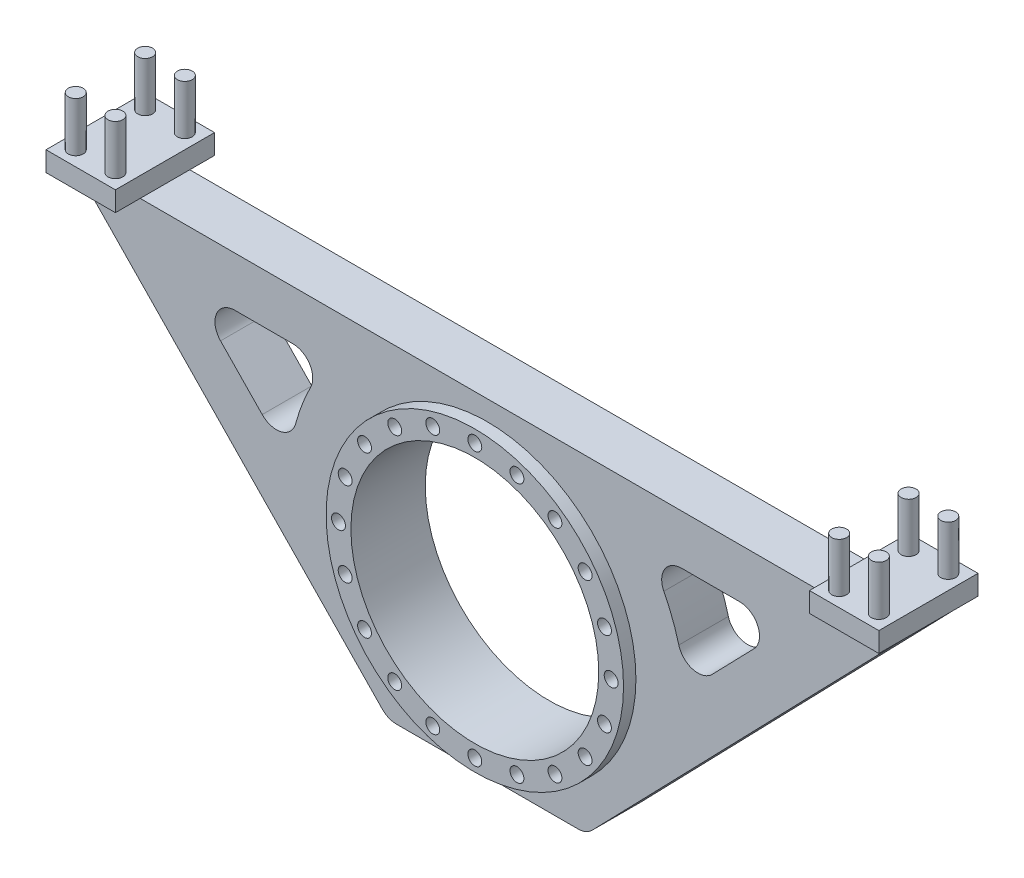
ISO-10303-21;
HEADER;
FILE_DESCRIPTION(('STEP AP214'),'2;1');
FILE_NAME('part.step','',(''),(''),'','','');
FILE_SCHEMA(('AUTOMOTIVE_DESIGN { 1 0 10303 214 1 1 1 1 }'));
ENDSEC;
DATA;
#1=APPLICATION_CONTEXT('core data for automotive mechanical design processes');
#2=APPLICATION_PROTOCOL_DEFINITION('international standard','automotive_design',2000,#1);
#3=PRODUCT_CONTEXT('',#1,'mechanical');
#4=PRODUCT('Part','Part','',(#3));
#5=PRODUCT_RELATED_PRODUCT_CATEGORY('part','',(#4));
#6=PRODUCT_DEFINITION_FORMATION('','',#4);
#7=PRODUCT_DEFINITION_CONTEXT('part definition',#1,'design');
#8=PRODUCT_DEFINITION('design','',#6,#7);
#9=PRODUCT_DEFINITION_SHAPE('','',#8);
#10=(LENGTH_UNIT() NAMED_UNIT(*) SI_UNIT(.MILLI.,.METRE.));
#11=(NAMED_UNIT(*) PLANE_ANGLE_UNIT() SI_UNIT($,.RADIAN.));
#12=(NAMED_UNIT(*) SI_UNIT($,.STERADIAN.) SOLID_ANGLE_UNIT());
#13=UNCERTAINTY_MEASURE_WITH_UNIT(LENGTH_MEASURE(1.E-05),#10,'distance_accuracy_value','');
#14=(GEOMETRIC_REPRESENTATION_CONTEXT(3) GLOBAL_UNCERTAINTY_ASSIGNED_CONTEXT((#13)) GLOBAL_UNIT_ASSIGNED_CONTEXT((#10,
#11,#12)) REPRESENTATION_CONTEXT('',''));
#15=CARTESIAN_POINT('',(0.,0.,0.));
#16=DIRECTION('',(0.,0.,1.));
#17=DIRECTION('',(1.,0.,0.));
#18=AXIS2_PLACEMENT_3D('',#15,#16,#17);
#19=CARTESIAN_POINT('',(0.,170.,25.));
#20=DIRECTION('',(0.,-1.,0.));
#21=DIRECTION('',(0.,0.,-1.));
#22=AXIS2_PLACEMENT_3D('',#19,#20,#21);
#23=PLANE('',#22);
#24=DIRECTION('',(0.,0.,-1.));
#25=VECTOR('',#24,1.);
#26=CARTESIAN_POINT('',(350.,170.,50.));
#27=LINE('',#26,#25);
#28=CARTESIAN_POINT('',(350.,170.,25.));
#29=VERTEX_POINT('',#28);
#30=CARTESIAN_POINT('',(350.,170.,-25.));
#31=VERTEX_POINT('',#30);
#32=EDGE_CURVE('E279',#29,#31,#27,.T.);
#33=ORIENTED_EDGE('',*,*,#32,.T.);
#34=DIRECTION('',(-1.,0.,0.));
#35=VECTOR('',#34,1.);
#36=CARTESIAN_POINT('',(0.,170.,-25.));
#37=LINE('',#36,#35);
#38=CARTESIAN_POINT('',(-350.,170.,-25.));
#39=VERTEX_POINT('',#38);
#40=EDGE_CURVE('E408',#31,#39,#37,.T.);
#41=ORIENTED_EDGE('',*,*,#40,.T.);
#42=DIRECTION('',(0.,0.,-1.));
#43=VECTOR('',#42,1.);
#44=CARTESIAN_POINT('',(-350.,170.,50.));
#45=LINE('',#44,#43);
#46=CARTESIAN_POINT('',(-350.,170.,25.));
#47=VERTEX_POINT('',#46);
#48=EDGE_CURVE('E314',#47,#39,#45,.T.);
#49=ORIENTED_EDGE('',*,*,#48,.F.);
#50=DIRECTION('',(-1.,0.,0.));
#51=VECTOR('',#50,1.);
#52=CARTESIAN_POINT('',(0.,170.,25.));
#53=LINE('',#52,#51);
#54=EDGE_CURVE('E361',#29,#47,#53,.T.);
#55=ORIENTED_EDGE('',*,*,#54,.F.);
#56=EDGE_LOOP('',(#33,#41,#49,#55));
#57=FACE_BOUND('',#56,.T.);
#58=ADVANCED_FACE('F44',(#57),#23,.F.);
#59=CARTESIAN_POINT('',(0.,-160.,25.));
#60=DIRECTION('',(0.,-1.,0.));
#61=DIRECTION('',(0.,0.,-1.));
#62=AXIS2_PLACEMENT_3D('',#59,#60,#61);
#63=PLANE('',#62);
#64=DIRECTION('',(-1.,0.,0.));
#65=VECTOR('',#64,1.);
#66=CARTESIAN_POINT('',(0.,-160.,25.));
#67=LINE('',#66,#65);
#68=CARTESIAN_POINT('',(91.5349213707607,-160.,25.));
#69=VERTEX_POINT('',#68);
#70=CARTESIAN_POINT('',(-91.5349213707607,-160.,25.));
#71=VERTEX_POINT('',#70);
#72=EDGE_CURVE('E353',#69,#71,#67,.T.);
#73=ORIENTED_EDGE('',*,*,#72,.T.);
#74=DIRECTION('',(0.,0.,-1.));
#75=VECTOR('',#74,1.);
#76=CARTESIAN_POINT('',(-91.5349213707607,-160.,25.));
#77=LINE('',#76,#75);
#78=CARTESIAN_POINT('',(-91.5349213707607,-160.,-25.));
#79=VERTEX_POINT('',#78);
#80=EDGE_CURVE('E440',#71,#79,#77,.T.);
#81=ORIENTED_EDGE('',*,*,#80,.T.);
#82=DIRECTION('',(-1.,0.,0.));
#83=VECTOR('',#82,1.);
#84=CARTESIAN_POINT('',(0.,-160.,-25.));
#85=LINE('',#84,#83);
#86=CARTESIAN_POINT('',(91.5349213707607,-160.,-25.));
#87=VERTEX_POINT('',#86);
#88=EDGE_CURVE('E399',#87,#79,#85,.T.);
#89=ORIENTED_EDGE('',*,*,#88,.F.);
#90=DIRECTION('',(0.,0.,-1.));
#91=VECTOR('',#90,1.);
#92=CARTESIAN_POINT('',(91.5349213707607,-160.,25.));
#93=LINE('',#92,#91);
#94=EDGE_CURVE('E438',#87,#69,#93,.F.);
#95=ORIENTED_EDGE('',*,*,#94,.T.);
#96=EDGE_LOOP('',(#73,#81,#89,#95));
#97=FACE_BOUND('',#96,.T.);
#98=ADVANCED_FACE('F454',(#97),#63,.T.);
#99=CARTESIAN_POINT('',(131.500236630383,-127.515380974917,25.));
#100=DIRECTION('',(-0.717900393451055,0.69614583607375,0.));
#101=DIRECTION('',(-0.69614583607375,-0.717900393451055,0.));
#102=AXIS2_PLACEMENT_3D('',#99,#100,#101);
#103=PLANE('',#102);
#104=DIRECTION('',(0.69614583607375,0.717900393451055,0.));
#105=VECTOR('',#104,1.);
#106=CARTESIAN_POINT('',(131.500236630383,-127.515380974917,25.));
#107=LINE('',#106,#105);
#108=CARTESIAN_POINT('',(105.892929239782,-153.922916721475,25.));
#109=VERTEX_POINT('',#108);
#110=CARTESIAN_POINT('',(420.,170.,25.));
#111=VERTEX_POINT('',#110);
#112=EDGE_CURVE('E356',#109,#111,#107,.T.);
#113=ORIENTED_EDGE('',*,*,#112,.F.);
#114=DIRECTION('',(0.,0.,-1.));
#115=VECTOR('',#114,1.);
#116=CARTESIAN_POINT('',(105.892929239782,-153.922916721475,-25.));
#117=LINE('',#116,#115);
#118=CARTESIAN_POINT('',(105.892929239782,-153.922916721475,-25.));
#119=VERTEX_POINT('',#118);
#120=EDGE_CURVE('E11',#109,#119,#117,.T.);
#121=ORIENTED_EDGE('',*,*,#120,.T.);
#122=DIRECTION('',(0.69614583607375,0.717900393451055,0.));
#123=VECTOR('',#122,1.);
#124=CARTESIAN_POINT('',(131.500236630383,-127.515380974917,-25.));
#125=LINE('',#124,#123);
#126=CARTESIAN_POINT('',(420.,170.,-25.));
#127=VERTEX_POINT('',#126);
#128=EDGE_CURVE('E402',#119,#127,#125,.T.);
#129=ORIENTED_EDGE('',*,*,#128,.T.);
#130=DIRECTION('',(0.,0.,-1.));
#131=VECTOR('',#130,1.);
#132=CARTESIAN_POINT('',(420.,170.,25.));
#133=LINE('',#132,#131);
#134=EDGE_CURVE('E413',#111,#127,#133,.T.);
#135=ORIENTED_EDGE('',*,*,#134,.F.);
#136=EDGE_LOOP('',(#113,#121,#129,#135));
#137=FACE_BOUND('',#136,.T.);
#138=ADVANCED_FACE('F525',(#137),#103,.F.);
#139=CARTESIAN_POINT('',(-195.959179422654,100.,25.));
#140=DIRECTION('',(0.,0.,-1.));
#141=DIRECTION('',(-1.,0.,0.));
#142=AXIS2_PLACEMENT_3D('',#139,#140,#141);
#143=CYLINDRICAL_SURFACE('',#142,20.);
#144=CARTESIAN_POINT('',(-195.959179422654,100.,-25.));
#145=DIRECTION('',(0.,0.,1.));
#146=DIRECTION('',(1.,0.,0.));
#147=AXIS2_PLACEMENT_3D('',#144,#145,#146);
#148=CIRCLE('',#147,20.);
#149=CARTESIAN_POINT('',(-178.144708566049,90.9090909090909,-25.));
#150=VERTEX_POINT('',#149);
#151=CARTESIAN_POINT('',(-195.959179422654,120.,-25.));
#152=VERTEX_POINT('',#151);
#153=EDGE_CURVE('E381',#150,#152,#148,.T.);
#154=ORIENTED_EDGE('',*,*,#153,.F.);
#155=DIRECTION('',(0.,0.,-1.));
#156=VECTOR('',#155,1.);
#157=CARTESIAN_POINT('',(-178.144708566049,90.9090909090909,25.));
#158=LINE('',#157,#156);
#159=CARTESIAN_POINT('',(-178.144708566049,90.9090909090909,25.));
#160=VERTEX_POINT('',#159);
#161=EDGE_CURVE('E414',#160,#150,#158,.T.);
#162=ORIENTED_EDGE('',*,*,#161,.F.);
#163=CARTESIAN_POINT('',(-195.959179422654,100.,25.));
#164=DIRECTION('',(0.,0.,1.));
#165=DIRECTION('',(1.,0.,0.));
#166=AXIS2_PLACEMENT_3D('',#163,#164,#165);
#167=CIRCLE('',#166,20.);
#168=CARTESIAN_POINT('',(-195.959179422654,120.,25.));
#169=VERTEX_POINT('',#168);
#170=EDGE_CURVE('E335',#160,#169,#167,.T.);
#171=ORIENTED_EDGE('',*,*,#170,.T.);
#172=DIRECTION('',(0.,0.,-1.));
#173=VECTOR('',#172,1.);
#174=CARTESIAN_POINT('',(-195.959179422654,120.,25.));
#175=LINE('',#174,#173);
#176=EDGE_CURVE('E416',#169,#152,#175,.T.);
#177=ORIENTED_EDGE('',*,*,#176,.T.);
#178=EDGE_LOOP('',(#154,#162,#171,#177));
#179=FACE_BOUND('',#178,.T.);
#180=ADVANCED_FACE('F531',(#179),#143,.F.);
#181=CARTESIAN_POINT('',(0.,0.,25.));
#182=DIRECTION('',(0.,0.,-1.));
#183=DIRECTION('',(-1.,0.,0.));
#184=AXIS2_PLACEMENT_3D('',#181,#182,#183);
#185=CYLINDRICAL_SURFACE('',#184,200.);
#186=CARTESIAN_POINT('',(0.,0.,-25.));
#187=DIRECTION('',(0.,0.,1.));
#188=DIRECTION('',(1.,0.,0.));
#189=AXIS2_PLACEMENT_3D('',#186,#187,#188);
#190=CIRCLE('',#189,200.);
#191=CARTESIAN_POINT('',(-193.255083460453,51.5021622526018,-25.));
#192=VERTEX_POINT('',#191);
#193=EDGE_CURVE('E384',#150,#192,#190,.T.);
#194=ORIENTED_EDGE('',*,*,#193,.T.);
#195=DIRECTION('',(0.,0.,-1.));
#196=VECTOR('',#195,1.);
#197=CARTESIAN_POINT('',(-193.255083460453,51.5021622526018,25.));
#198=LINE('',#197,#196);
#199=CARTESIAN_POINT('',(-193.255083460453,51.5021622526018,25.));
#200=VERTEX_POINT('',#199);
#201=EDGE_CURVE('E425',#200,#192,#198,.T.);
#202=ORIENTED_EDGE('',*,*,#201,.F.);
#203=CARTESIAN_POINT('',(0.,0.,25.));
#204=DIRECTION('',(0.,0.,1.));
#205=DIRECTION('',(1.,0.,0.));
#206=AXIS2_PLACEMENT_3D('',#203,#204,#205);
#207=CIRCLE('',#206,200.);
#208=EDGE_CURVE('E338',#160,#200,#207,.T.);
#209=ORIENTED_EDGE('',*,*,#208,.F.);
#210=ORIENTED_EDGE('',*,*,#161,.T.);
#211=EDGE_LOOP('',(#194,#202,#209,#210));
#212=FACE_BOUND('',#211,.T.);
#213=ADVANCED_FACE('F552',(#212),#185,.T.);
#214=CARTESIAN_POINT('',(-212.580591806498,56.652378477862,25.));
#215=DIRECTION('',(0.,0.,-1.));
#216=DIRECTION('',(-1.,0.,0.));
#217=AXIS2_PLACEMENT_3D('',#214,#215,#216);
#218=CYLINDRICAL_SURFACE('',#217,20.);
#219=CARTESIAN_POINT('',(-212.580591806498,56.652378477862,-25.));
#220=DIRECTION('',(0.,0.,1.));
#221=DIRECTION('',(1.,0.,0.));
#222=AXIS2_PLACEMENT_3D('',#219,#220,#221);
#223=CIRCLE('',#222,20.);
#224=CARTESIAN_POINT('',(-226.938599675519,42.729461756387,-25.));
#225=VERTEX_POINT('',#224);
#226=EDGE_CURVE('E387',#225,#192,#223,.T.);
#227=ORIENTED_EDGE('',*,*,#226,.F.);
#228=DIRECTION('',(0.,0.,-1.));
#229=VECTOR('',#228,1.);
#230=CARTESIAN_POINT('',(-226.938599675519,42.729461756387,25.));
#231=LINE('',#230,#229);
#232=CARTESIAN_POINT('',(-226.938599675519,42.729461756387,25.));
#233=VERTEX_POINT('',#232);
#234=EDGE_CURVE('E423',#233,#225,#231,.T.);
#235=ORIENTED_EDGE('',*,*,#234,.F.);
#236=CARTESIAN_POINT('',(-212.580591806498,56.652378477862,25.));
#237=DIRECTION('',(0.,0.,1.));
#238=DIRECTION('',(1.,0.,0.));
#239=AXIS2_PLACEMENT_3D('',#236,#237,#238);
#240=CIRCLE('',#239,20.);
#241=EDGE_CURVE('E340',#233,#200,#240,.T.);
#242=ORIENTED_EDGE('',*,*,#241,.T.);
#243=ORIENTED_EDGE('',*,*,#201,.T.);
#244=EDGE_LOOP('',(#227,#235,#242,#243));
#245=FACE_BOUND('',#244,.T.);
#246=ADVANCED_FACE('F548',(#245),#218,.F.);
#247=CARTESIAN_POINT('',(-95.6052169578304,-92.7080891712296,25.));
#248=DIRECTION('',(-0.717900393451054,-0.696145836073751,0.));
#249=DIRECTION('',(0.696145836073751,-0.717900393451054,0.));
#250=AXIS2_PLACEMENT_3D('',#247,#248,#249);
#251=PLANE('',#250);
#252=DIRECTION('',(-0.696145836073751,0.717900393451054,0.));
#253=VECTOR('',#252,1.);
#254=CARTESIAN_POINT('',(-95.6052169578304,-92.7080891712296,-25.));
#255=LINE('',#254,#253);
#256=CARTESIAN_POINT('',(-268.972656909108,86.077083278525,-25.));
#257=VERTEX_POINT('',#256);
#258=EDGE_CURVE('E390',#225,#257,#255,.T.);
#259=ORIENTED_EDGE('',*,*,#258,.T.);
#260=DIRECTION('',(0.,0.,-1.));
#261=VECTOR('',#260,1.);
#262=CARTESIAN_POINT('',(-268.972656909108,86.077083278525,25.));
#263=LINE('',#262,#261);
#264=CARTESIAN_POINT('',(-268.972656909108,86.077083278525,25.));
#265=VERTEX_POINT('',#264);
#266=EDGE_CURVE('E421',#265,#257,#263,.T.);
#267=ORIENTED_EDGE('',*,*,#266,.F.);
#268=DIRECTION('',(-0.696145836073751,0.717900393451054,0.));
#269=VECTOR('',#268,1.);
#270=CARTESIAN_POINT('',(-95.6052169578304,-92.7080891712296,25.));
#271=LINE('',#270,#269);
#272=EDGE_CURVE('E343',#233,#265,#271,.T.);
#273=ORIENTED_EDGE('',*,*,#272,.F.);
#274=ORIENTED_EDGE('',*,*,#234,.T.);
#275=EDGE_LOOP('',(#259,#267,#273,#274));
#276=FACE_BOUND('',#275,.T.);
#277=ADVANCED_FACE('F544',(#276),#251,.F.);
#278=CARTESIAN_POINT('',(-254.614649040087,100.,25.));
#279=DIRECTION('',(0.,0.,-1.));
#280=DIRECTION('',(-1.,0.,0.));
#281=AXIS2_PLACEMENT_3D('',#278,#279,#280);
#282=CYLINDRICAL_SURFACE('',#281,20.);
#283=CARTESIAN_POINT('',(-254.614649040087,100.,-25.));
#284=DIRECTION('',(0.,0.,1.));
#285=DIRECTION('',(1.,0.,0.));
#286=AXIS2_PLACEMENT_3D('',#283,#284,#285);
#287=CIRCLE('',#286,20.);
#288=CARTESIAN_POINT('',(-254.614649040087,120.,-25.));
#289=VERTEX_POINT('',#288);
#290=EDGE_CURVE('E393',#289,#257,#287,.T.);
#291=ORIENTED_EDGE('',*,*,#290,.F.);
#292=DIRECTION('',(0.,0.,-1.));
#293=VECTOR('',#292,1.);
#294=CARTESIAN_POINT('',(-254.614649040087,120.,25.));
#295=LINE('',#294,#293);
#296=CARTESIAN_POINT('',(-254.614649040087,120.,25.));
#297=VERTEX_POINT('',#296);
#298=EDGE_CURVE('E418',#297,#289,#295,.T.);
#299=ORIENTED_EDGE('',*,*,#298,.F.);
#300=CARTESIAN_POINT('',(-254.614649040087,100.,25.));
#301=DIRECTION('',(0.,0.,1.));
#302=DIRECTION('',(1.,0.,0.));
#303=AXIS2_PLACEMENT_3D('',#300,#301,#302);
#304=CIRCLE('',#303,20.);
#305=EDGE_CURVE('E345',#297,#265,#304,.T.);
#306=ORIENTED_EDGE('',*,*,#305,.T.);
#307=ORIENTED_EDGE('',*,*,#266,.T.);
#308=EDGE_LOOP('',(#291,#299,#306,#307));
#309=FACE_BOUND('',#308,.T.);
#310=ADVANCED_FACE('F540',(#309),#282,.F.);
#311=CARTESIAN_POINT('',(0.,0.,25.));
#312=DIRECTION('',(0.,0.,-1.));
#313=DIRECTION('',(-1.,0.,0.));
#314=AXIS2_PLACEMENT_3D('',#311,#312,#313);
#315=CYLINDRICAL_SURFACE('',#314,200.);
#316=CARTESIAN_POINT('',(0.,0.,-25.));
#317=DIRECTION('',(0.,0.,1.));
#318=DIRECTION('',(1.,0.,0.));
#319=AXIS2_PLACEMENT_3D('',#316,#317,#318);
#320=CIRCLE('',#319,200.);
#321=CARTESIAN_POINT('',(178.144708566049,90.9090909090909,-25.));
#322=VERTEX_POINT('',#321);
#323=CARTESIAN_POINT('',(193.255083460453,51.5021622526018,-25.));
#324=VERTEX_POINT('',#323);
#325=EDGE_CURVE('E318',#322,#324,#320,.F.);
#326=ORIENTED_EDGE('',*,*,#325,.F.);
#327=DIRECTION('',(0.,0.,-1.));
#328=VECTOR('',#327,1.);
#329=CARTESIAN_POINT('',(178.144708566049,90.9090909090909,25.));
#330=LINE('',#329,#328);
#331=CARTESIAN_POINT('',(178.144708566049,90.9090909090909,25.));
#332=VERTEX_POINT('',#331);
#333=EDGE_CURVE('E419',#332,#322,#330,.T.);
#334=ORIENTED_EDGE('',*,*,#333,.F.);
#335=CARTESIAN_POINT('',(0.,0.,25.));
#336=DIRECTION('',(0.,0.,1.));
#337=DIRECTION('',(1.,0.,0.));
#338=AXIS2_PLACEMENT_3D('',#335,#336,#337);
#339=CIRCLE('',#338,200.);
#340=CARTESIAN_POINT('',(193.255083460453,51.5021622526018,25.));
#341=VERTEX_POINT('',#340);
#342=EDGE_CURVE('E319',#332,#341,#339,.F.);
#343=ORIENTED_EDGE('',*,*,#342,.T.);
#344=DIRECTION('',(0.,0.,-1.));
#345=VECTOR('',#344,1.);
#346=CARTESIAN_POINT('',(193.255083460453,51.5021622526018,25.));
#347=LINE('',#346,#345);
#348=EDGE_CURVE('E363',#341,#324,#347,.T.);
#349=ORIENTED_EDGE('',*,*,#348,.T.);
#350=EDGE_LOOP('',(#326,#334,#343,#349));
#351=FACE_BOUND('',#350,.T.);
#352=ADVANCED_FACE('F543',(#351),#315,.T.);
#353=CARTESIAN_POINT('',(195.959179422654,100.,25.));
#354=DIRECTION('',(0.,0.,-1.));
#355=DIRECTION('',(-1.,0.,0.));
#356=AXIS2_PLACEMENT_3D('',#353,#354,#355);
#357=CYLINDRICAL_SURFACE('',#356,20.);
#358=CARTESIAN_POINT('',(195.959179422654,100.,-25.));
#359=DIRECTION('',(0.,0.,1.));
#360=DIRECTION('',(1.,0.,0.));
#361=AXIS2_PLACEMENT_3D('',#358,#359,#360);
#362=CIRCLE('',#361,20.);
#363=CARTESIAN_POINT('',(195.959179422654,120.,-25.));
#364=VERTEX_POINT('',#363);
#365=EDGE_CURVE('E366',#322,#364,#362,.F.);
#366=ORIENTED_EDGE('',*,*,#365,.T.);
#367=DIRECTION('',(0.,0.,-1.));
#368=VECTOR('',#367,1.);
#369=CARTESIAN_POINT('',(195.959179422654,120.,25.));
#370=LINE('',#369,#368);
#371=CARTESIAN_POINT('',(195.959179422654,120.,25.));
#372=VERTEX_POINT('',#371);
#373=EDGE_CURVE('E435',#372,#364,#370,.T.);
#374=ORIENTED_EDGE('',*,*,#373,.F.);
#375=CARTESIAN_POINT('',(195.959179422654,100.,25.));
#376=DIRECTION('',(0.,0.,1.));
#377=DIRECTION('',(1.,0.,0.));
#378=AXIS2_PLACEMENT_3D('',#375,#376,#377);
#379=CIRCLE('',#378,20.);
#380=EDGE_CURVE('E322',#332,#372,#379,.F.);
#381=ORIENTED_EDGE('',*,*,#380,.F.);
#382=ORIENTED_EDGE('',*,*,#333,.T.);
#383=EDGE_LOOP('',(#366,#374,#381,#382));
#384=FACE_BOUND('',#383,.T.);
#385=ADVANCED_FACE('F573',(#384),#357,.F.);
#386=CARTESIAN_POINT('',(0.,120.,25.));
#387=DIRECTION('',(0.,-1.,0.));
#388=DIRECTION('',(0.,0.,-1.));
#389=AXIS2_PLACEMENT_3D('',#386,#387,#388);
#390=PLANE('',#389);
#391=DIRECTION('',(-1.,0.,0.));
#392=VECTOR('',#391,1.);
#393=CARTESIAN_POINT('',(0.,120.,-25.));
#394=LINE('',#393,#392);
#395=CARTESIAN_POINT('',(254.614649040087,120.,-25.));
#396=VERTEX_POINT('',#395);
#397=EDGE_CURVE('E369',#396,#364,#394,.T.);
#398=ORIENTED_EDGE('',*,*,#397,.F.);
#399=DIRECTION('',(0.,0.,-1.));
#400=VECTOR('',#399,1.);
#401=CARTESIAN_POINT('',(254.614649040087,120.,25.));
#402=LINE('',#401,#400);
#403=CARTESIAN_POINT('',(254.614649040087,120.,25.));
#404=VERTEX_POINT('',#403);
#405=EDGE_CURVE('E433',#404,#396,#402,.T.);
#406=ORIENTED_EDGE('',*,*,#405,.F.);
#407=DIRECTION('',(-1.,0.,0.));
#408=VECTOR('',#407,1.);
#409=CARTESIAN_POINT('',(0.,120.,25.));
#410=LINE('',#409,#408);
#411=EDGE_CURVE('E325',#404,#372,#410,.T.);
#412=ORIENTED_EDGE('',*,*,#411,.T.);
#413=ORIENTED_EDGE('',*,*,#373,.T.);
#414=EDGE_LOOP('',(#398,#406,#412,#413));
#415=FACE_BOUND('',#414,.T.);
#416=ADVANCED_FACE('F569',(#415),#390,.T.);
#417=CARTESIAN_POINT('',(254.614649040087,100.,25.));
#418=DIRECTION('',(0.,0.,-1.));
#419=DIRECTION('',(-1.,0.,0.));
#420=AXIS2_PLACEMENT_3D('',#417,#418,#419);
#421=CYLINDRICAL_SURFACE('',#420,20.);
#422=CARTESIAN_POINT('',(254.614649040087,100.,-25.));
#423=DIRECTION('',(0.,0.,1.));
#424=DIRECTION('',(1.,0.,0.));
#425=AXIS2_PLACEMENT_3D('',#422,#423,#424);
#426=CIRCLE('',#425,20.);
#427=CARTESIAN_POINT('',(268.972656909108,86.077083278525,-25.));
#428=VERTEX_POINT('',#427);
#429=EDGE_CURVE('E372',#396,#428,#426,.F.);
#430=ORIENTED_EDGE('',*,*,#429,.T.);
#431=DIRECTION('',(0.,0.,-1.));
#432=VECTOR('',#431,1.);
#433=CARTESIAN_POINT('',(268.972656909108,86.077083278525,25.));
#434=LINE('',#433,#432);
#435=CARTESIAN_POINT('',(268.972656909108,86.077083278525,25.));
#436=VERTEX_POINT('',#435);
#437=EDGE_CURVE('E431',#436,#428,#434,.T.);
#438=ORIENTED_EDGE('',*,*,#437,.F.);
#439=CARTESIAN_POINT('',(254.614649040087,100.,25.));
#440=DIRECTION('',(0.,0.,1.));
#441=DIRECTION('',(1.,0.,0.));
#442=AXIS2_PLACEMENT_3D('',#439,#440,#441);
#443=CIRCLE('',#442,20.);
#444=EDGE_CURVE('E328',#404,#436,#443,.F.);
#445=ORIENTED_EDGE('',*,*,#444,.F.);
#446=ORIENTED_EDGE('',*,*,#405,.T.);
#447=EDGE_LOOP('',(#430,#438,#445,#446));
#448=FACE_BOUND('',#447,.T.);
#449=ADVANCED_FACE('F565',(#448),#421,.F.);
#450=CARTESIAN_POINT('',(95.6052169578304,-92.7080891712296,25.));
#451=DIRECTION('',(-0.717900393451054,0.696145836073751,0.));
#452=DIRECTION('',(-0.696145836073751,-0.717900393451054,0.));
#453=AXIS2_PLACEMENT_3D('',#450,#451,#452);
#454=PLANE('',#453);
#455=DIRECTION('',(0.696145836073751,0.717900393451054,0.));
#456=VECTOR('',#455,1.);
#457=CARTESIAN_POINT('',(95.6052169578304,-92.7080891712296,-25.));
#458=LINE('',#457,#456);
#459=CARTESIAN_POINT('',(226.938599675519,42.729461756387,-25.));
#460=VERTEX_POINT('',#459);
#461=EDGE_CURVE('E375',#460,#428,#458,.T.);
#462=ORIENTED_EDGE('',*,*,#461,.F.);
#463=DIRECTION('',(0.,0.,-1.));
#464=VECTOR('',#463,1.);
#465=CARTESIAN_POINT('',(226.938599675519,42.729461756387,25.));
#466=LINE('',#465,#464);
#467=CARTESIAN_POINT('',(226.938599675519,42.729461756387,25.));
#468=VERTEX_POINT('',#467);
#469=EDGE_CURVE('E429',#468,#460,#466,.T.);
#470=ORIENTED_EDGE('',*,*,#469,.F.);
#471=DIRECTION('',(0.696145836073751,0.717900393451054,0.));
#472=VECTOR('',#471,1.);
#473=CARTESIAN_POINT('',(95.6052169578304,-92.7080891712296,25.));
#474=LINE('',#473,#472);
#475=EDGE_CURVE('E330',#468,#436,#474,.T.);
#476=ORIENTED_EDGE('',*,*,#475,.T.);
#477=ORIENTED_EDGE('',*,*,#437,.T.);
#478=EDGE_LOOP('',(#462,#470,#476,#477));
#479=FACE_BOUND('',#478,.T.);
#480=ADVANCED_FACE('F538',(#479),#454,.T.);
#481=CARTESIAN_POINT('',(0.,120.,25.));
#482=DIRECTION('',(0.,1.,0.));
#483=DIRECTION('',(0.,0.,1.));
#484=AXIS2_PLACEMENT_3D('',#481,#482,#483);
#485=PLANE('',#484);
#486=DIRECTION('',(1.,0.,0.));
#487=VECTOR('',#486,1.);
#488=CARTESIAN_POINT('',(0.,120.,-25.));
#489=LINE('',#488,#487);
#490=EDGE_CURVE('E396',#289,#152,#489,.T.);
#491=ORIENTED_EDGE('',*,*,#490,.T.);
#492=ORIENTED_EDGE('',*,*,#176,.F.);
#493=DIRECTION('',(1.,0.,0.));
#494=VECTOR('',#493,1.);
#495=CARTESIAN_POINT('',(0.,120.,25.));
#496=LINE('',#495,#494);
#497=EDGE_CURVE('E348',#297,#169,#496,.T.);
#498=ORIENTED_EDGE('',*,*,#497,.F.);
#499=ORIENTED_EDGE('',*,*,#298,.T.);
#500=EDGE_LOOP('',(#491,#492,#498,#499));
#501=FACE_BOUND('',#500,.T.);
#502=ADVANCED_FACE('F534',(#501),#485,.F.);
#503=CARTESIAN_POINT('',(212.580591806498,56.652378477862,25.));
#504=DIRECTION('',(0.,0.,-1.));
#505=DIRECTION('',(-1.,0.,0.));
#506=AXIS2_PLACEMENT_3D('',#503,#504,#505);
#507=CYLINDRICAL_SURFACE('',#506,20.);
#508=CARTESIAN_POINT('',(212.580591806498,56.652378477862,-25.));
#509=DIRECTION('',(0.,0.,1.));
#510=DIRECTION('',(1.,0.,0.));
#511=AXIS2_PLACEMENT_3D('',#508,#509,#510);
#512=CIRCLE('',#511,20.);
#513=EDGE_CURVE('E378',#460,#324,#512,.F.);
#514=ORIENTED_EDGE('',*,*,#513,.T.);
#515=ORIENTED_EDGE('',*,*,#348,.F.);
#516=CARTESIAN_POINT('',(212.580591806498,56.652378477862,25.));
#517=DIRECTION('',(0.,0.,1.));
#518=DIRECTION('',(1.,0.,0.));
#519=AXIS2_PLACEMENT_3D('',#516,#517,#518);
#520=CIRCLE('',#519,20.);
#521=EDGE_CURVE('E333',#468,#341,#520,.F.);
#522=ORIENTED_EDGE('',*,*,#521,.F.);
#523=ORIENTED_EDGE('',*,*,#469,.T.);
#524=EDGE_LOOP('',(#514,#515,#522,#523));
#525=FACE_BOUND('',#524,.T.);
#526=ADVANCED_FACE('F537',(#525),#507,.F.);
#527=CARTESIAN_POINT('',(-131.500236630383,-127.515380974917,25.));
#528=DIRECTION('',(-0.717900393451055,-0.69614583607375,0.));
#529=DIRECTION('',(0.69614583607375,-0.717900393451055,0.));
#530=AXIS2_PLACEMENT_3D('',#527,#528,#529);
#531=PLANE('',#530);
#532=DIRECTION('',(-0.69614583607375,0.717900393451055,0.));
#533=VECTOR('',#532,1.);
#534=CARTESIAN_POINT('',(-131.500236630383,-127.515380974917,-25.));
#535=LINE('',#534,#533);
#536=CARTESIAN_POINT('',(-105.892929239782,-153.922916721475,-25.));
#537=VERTEX_POINT('',#536);
#538=CARTESIAN_POINT('',(-420.,170.,-25.));
#539=VERTEX_POINT('',#538);
#540=EDGE_CURVE('E323',#537,#539,#535,.T.);
#541=ORIENTED_EDGE('',*,*,#540,.F.);
#542=DIRECTION('',(0.,0.,-1.));
#543=VECTOR('',#542,1.);
#544=CARTESIAN_POINT('',(-105.892929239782,-153.922916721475,25.));
#545=LINE('',#544,#543);
#546=CARTESIAN_POINT('',(-105.892929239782,-153.922916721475,25.));
#547=VERTEX_POINT('',#546);
#548=EDGE_CURVE('E67',#537,#547,#545,.F.);
#549=ORIENTED_EDGE('',*,*,#548,.T.);
#550=DIRECTION('',(-0.69614583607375,0.717900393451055,0.));
#551=VECTOR('',#550,1.);
#552=CARTESIAN_POINT('',(-131.500236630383,-127.515380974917,25.));
#553=LINE('',#552,#551);
#554=CARTESIAN_POINT('',(-420.,170.,25.));
#555=VERTEX_POINT('',#554);
#556=EDGE_CURVE('E360',#547,#555,#553,.T.);
#557=ORIENTED_EDGE('',*,*,#556,.T.);
#558=DIRECTION('',(0.,0.,-1.));
#559=VECTOR('',#558,1.);
#560=CARTESIAN_POINT('',(-420.,170.,25.));
#561=LINE('',#560,#559);
#562=EDGE_CURVE('E410',#555,#539,#561,.T.);
#563=ORIENTED_EDGE('',*,*,#562,.T.);
#564=EDGE_LOOP('',(#541,#549,#557,#563));
#565=FACE_BOUND('',#564,.T.);
#566=ADVANCED_FACE('F461',(#565),#531,.T.);
#567=CARTESIAN_POINT('',(0.,0.,25.));
#568=DIRECTION('',(0.,0.,1.));
#569=DIRECTION('',(1.,0.,0.));
#570=AXIS2_PLACEMENT_3D('',#567,#568,#569);
#571=PLANE('',#570);
#572=ORIENTED_EDGE('',*,*,#342,.F.);
#573=ORIENTED_EDGE('',*,*,#380,.T.);
#574=ORIENTED_EDGE('',*,*,#411,.F.);
#575=ORIENTED_EDGE('',*,*,#444,.T.);
#576=ORIENTED_EDGE('',*,*,#475,.F.);
#577=ORIENTED_EDGE('',*,*,#521,.T.);
#578=EDGE_LOOP('',(#572,#573,#574,#575,#576,#577));
#579=FACE_BOUND('',#578,.T.);
#580=ORIENTED_EDGE('',*,*,#170,.F.);
#581=ORIENTED_EDGE('',*,*,#208,.T.);
#582=ORIENTED_EDGE('',*,*,#241,.F.);
#583=ORIENTED_EDGE('',*,*,#272,.T.);
#584=ORIENTED_EDGE('',*,*,#305,.F.);
#585=ORIENTED_EDGE('',*,*,#497,.T.);
#586=EDGE_LOOP('',(#580,#581,#582,#583,#584,#585));
#587=FACE_BOUND('',#586,.T.);
#588=CARTESIAN_POINT('',(0.,0.,25.));
#589=DIRECTION('',(0.,0.,1.));
#590=DIRECTION('',(1.,0.,0.));
#591=AXIS2_PLACEMENT_3D('',#588,#589,#590);
#592=CIRCLE('',#591,150.);
#593=CARTESIAN_POINT('',(150.,0.,25.));
#594=VERTEX_POINT('',#593);
#595=EDGE_CURVE('E350',#594,#594,#592,.T.);
#596=ORIENTED_EDGE('',*,*,#595,.F.);
#597=EDGE_LOOP('',(#596));
#598=FACE_BOUND('',#597,.T.);
#599=ORIENTED_EDGE('',*,*,#556,.F.);
#600=CARTESIAN_POINT('',(-91.5349213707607,-140.,25.));
#601=DIRECTION('',(0.,0.,1.));
#602=DIRECTION('',(1.,0.,0.));
#603=AXIS2_PLACEMENT_3D('',#600,#601,#602);
#604=CIRCLE('',#603,20.);
#605=EDGE_CURVE('E52',#547,#71,#604,.T.);
#606=ORIENTED_EDGE('',*,*,#605,.T.);
#607=ORIENTED_EDGE('',*,*,#72,.F.);
#608=CARTESIAN_POINT('',(91.5349213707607,-140.,25.));
#609=DIRECTION('',(0.,0.,1.));
#610=DIRECTION('',(1.,0.,0.));
#611=AXIS2_PLACEMENT_3D('',#608,#609,#610);
#612=CIRCLE('',#611,20.);
#613=EDGE_CURVE('E59',#69,#109,#612,.T.);
#614=ORIENTED_EDGE('',*,*,#613,.T.);
#615=ORIENTED_EDGE('',*,*,#112,.T.);
#616=EDGE_CURVE('E239',#111,#29,#53,.T.);
#617=ORIENTED_EDGE('',*,*,#616,.T.);
#618=ORIENTED_EDGE('',*,*,#54,.T.);
#619=EDGE_CURVE('E358',#47,#555,#53,.T.);
#620=ORIENTED_EDGE('',*,*,#619,.T.);
#621=EDGE_LOOP('',(#599,#606,#607,#614,#615,#617,#618,#620));
#622=FACE_BOUND('',#621,.T.);
#623=ADVANCED_FACE('F449',(#579,#587,#598,#622),#571,.T.);
#624=CARTESIAN_POINT('',(0.,0.,-25.));
#625=DIRECTION('',(0.,0.,1.));
#626=DIRECTION('',(1.,0.,0.));
#627=AXIS2_PLACEMENT_3D('',#624,#625,#626);
#628=PLANE('',#627);
#629=ORIENTED_EDGE('',*,*,#325,.T.);
#630=ORIENTED_EDGE('',*,*,#513,.F.);
#631=ORIENTED_EDGE('',*,*,#461,.T.);
#632=ORIENTED_EDGE('',*,*,#429,.F.);
#633=ORIENTED_EDGE('',*,*,#397,.T.);
#634=ORIENTED_EDGE('',*,*,#365,.F.);
#635=EDGE_LOOP('',(#629,#630,#631,#632,#633,#634));
#636=FACE_BOUND('',#635,.T.);
#637=ORIENTED_EDGE('',*,*,#153,.T.);
#638=ORIENTED_EDGE('',*,*,#490,.F.);
#639=ORIENTED_EDGE('',*,*,#290,.T.);
#640=ORIENTED_EDGE('',*,*,#258,.F.);
#641=ORIENTED_EDGE('',*,*,#226,.T.);
#642=ORIENTED_EDGE('',*,*,#193,.F.);
#643=EDGE_LOOP('',(#637,#638,#639,#640,#641,#642));
#644=FACE_BOUND('',#643,.T.);
#645=CARTESIAN_POINT('',(0.,0.,-25.));
#646=DIRECTION('',(0.,0.,1.));
#647=DIRECTION('',(1.,0.,0.));
#648=AXIS2_PLACEMENT_3D('',#645,#646,#647);
#649=CIRCLE('',#648,150.);
#650=CARTESIAN_POINT('',(150.,0.,-25.));
#651=VERTEX_POINT('',#650);
#652=EDGE_CURVE('E264',#651,#651,#649,.F.);
#653=ORIENTED_EDGE('',*,*,#652,.F.);
#654=EDGE_LOOP('',(#653));
#655=FACE_BOUND('',#654,.T.);
#656=ORIENTED_EDGE('',*,*,#88,.T.);
#657=CARTESIAN_POINT('',(-91.5349213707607,-140.,-25.));
#658=DIRECTION('',(0.,0.,1.));
#659=DIRECTION('',(1.,0.,0.));
#660=AXIS2_PLACEMENT_3D('',#657,#658,#659);
#661=CIRCLE('',#660,20.);
#662=EDGE_CURVE('E445',#79,#537,#661,.F.);
#663=ORIENTED_EDGE('',*,*,#662,.T.);
#664=ORIENTED_EDGE('',*,*,#540,.T.);
#665=EDGE_CURVE('E404',#39,#539,#37,.T.);
#666=ORIENTED_EDGE('',*,*,#665,.F.);
#667=ORIENTED_EDGE('',*,*,#40,.F.);
#668=EDGE_CURVE('E405',#127,#31,#37,.T.);
#669=ORIENTED_EDGE('',*,*,#668,.F.);
#670=ORIENTED_EDGE('',*,*,#128,.F.);
#671=CARTESIAN_POINT('',(91.5349213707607,-140.,-25.));
#672=DIRECTION('',(0.,0.,1.));
#673=DIRECTION('',(1.,0.,0.));
#674=AXIS2_PLACEMENT_3D('',#671,#672,#673);
#675=CIRCLE('',#674,20.);
#676=EDGE_CURVE('E443',#119,#87,#675,.F.);
#677=ORIENTED_EDGE('',*,*,#676,.T.);
#678=EDGE_LOOP('',(#656,#663,#664,#666,#667,#669,#670,#677));
#679=FACE_BOUND('',#678,.T.);
#680=ADVANCED_FACE('F459',(#636,#644,#655,#679),#628,.F.);
#681=CARTESIAN_POINT('',(0.,170.,50.));
#682=DIRECTION('',(0.,1.,0.));
#683=DIRECTION('',(0.,0.,1.));
#684=AXIS2_PLACEMENT_3D('',#681,#682,#683);
#685=PLANE('',#684);
#686=CARTESIAN_POINT('',(-350.,170.,-50.));
#687=VERTEX_POINT('',#686);
#688=EDGE_CURVE('E309',#39,#687,#45,.T.);
#689=ORIENTED_EDGE('',*,*,#688,.F.);
#690=ORIENTED_EDGE('',*,*,#665,.T.);
#691=DIRECTION('',(0.,0.,-1.));
#692=VECTOR('',#691,1.);
#693=CARTESIAN_POINT('',(-420.,170.,50.));
#694=LINE('',#693,#692);
#695=CARTESIAN_POINT('',(-420.,170.,-50.));
#696=VERTEX_POINT('',#695);
#697=EDGE_CURVE('E313',#539,#696,#694,.T.);
#698=ORIENTED_EDGE('',*,*,#697,.T.);
#699=DIRECTION('',(1.,0.,0.));
#700=VECTOR('',#699,1.);
#701=CARTESIAN_POINT('',(0.,170.,-50.));
#702=LINE('',#701,#700);
#703=EDGE_CURVE('E298',#696,#687,#702,.T.);
#704=ORIENTED_EDGE('',*,*,#703,.T.);
#705=EDGE_LOOP('',(#689,#690,#698,#704));
#706=FACE_BOUND('',#705,.T.);
#707=ADVANCED_FACE('F468',(#706),#685,.F.);
#708=CARTESIAN_POINT('',(-420.,0.,50.));
#709=DIRECTION('',(-1.,0.,0.));
#710=DIRECTION('',(0.,0.,1.));
#711=AXIS2_PLACEMENT_3D('',#708,#709,#710);
#712=PLANE('',#711);
#713=DIRECTION('',(0.,1.,0.));
#714=VECTOR('',#713,1.);
#715=CARTESIAN_POINT('',(-420.,0.,-50.));
#716=LINE('',#715,#714);
#717=CARTESIAN_POINT('',(-420.,190.,-50.));
#718=VERTEX_POINT('',#717);
#719=EDGE_CURVE('E242',#696,#718,#716,.T.);
#720=ORIENTED_EDGE('',*,*,#719,.F.);
#721=ORIENTED_EDGE('',*,*,#697,.F.);
#722=ORIENTED_EDGE('',*,*,#562,.F.);
#723=CARTESIAN_POINT('',(-420.,170.,50.));
#724=VERTEX_POINT('',#723);
#725=EDGE_CURVE('E315',#724,#555,#694,.T.);
#726=ORIENTED_EDGE('',*,*,#725,.F.);
#727=DIRECTION('',(0.,1.,0.));
#728=VECTOR('',#727,1.);
#729=CARTESIAN_POINT('',(-420.,0.,50.));
#730=LINE('',#729,#728);
#731=CARTESIAN_POINT('',(-420.,190.,50.));
#732=VERTEX_POINT('',#731);
#733=EDGE_CURVE('E283',#724,#732,#730,.T.);
#734=ORIENTED_EDGE('',*,*,#733,.T.);
#735=DIRECTION('',(0.,0.,-1.));
#736=VECTOR('',#735,1.);
#737=CARTESIAN_POINT('',(-420.,190.,50.));
#738=LINE('',#737,#736);
#739=EDGE_CURVE('E295',#732,#718,#738,.T.);
#740=ORIENTED_EDGE('',*,*,#739,.T.);
#741=EDGE_LOOP('',(#720,#721,#722,#726,#734,#740));
#742=FACE_BOUND('',#741,.T.);
#743=ADVANCED_FACE('F472',(#742),#712,.T.);
#744=ORIENTED_EDGE('',*,*,#619,.F.);
#745=CARTESIAN_POINT('',(-350.,170.,50.));
#746=VERTEX_POINT('',#745);
#747=EDGE_CURVE('E310',#746,#47,#45,.T.);
#748=ORIENTED_EDGE('',*,*,#747,.F.);
#749=DIRECTION('',(1.,0.,0.));
#750=VECTOR('',#749,1.);
#751=CARTESIAN_POINT('',(0.,170.,50.));
#752=LINE('',#751,#750);
#753=EDGE_CURVE('E286',#724,#746,#752,.T.);
#754=ORIENTED_EDGE('',*,*,#753,.F.);
#755=ORIENTED_EDGE('',*,*,#725,.T.);
#756=EDGE_LOOP('',(#744,#748,#754,#755));
#757=FACE_BOUND('',#756,.T.);
#758=ADVANCED_FACE('F489',(#757),#685,.F.);
#759=CARTESIAN_POINT('',(-350.,0.,50.));
#760=DIRECTION('',(1.,0.,0.));
#761=DIRECTION('',(0.,0.,-1.));
#762=AXIS2_PLACEMENT_3D('',#759,#760,#761);
#763=PLANE('',#762);
#764=DIRECTION('',(0.,-1.,0.));
#765=VECTOR('',#764,1.);
#766=CARTESIAN_POINT('',(-350.,0.,-50.));
#767=LINE('',#766,#765);
#768=CARTESIAN_POINT('',(-350.,190.,-50.));
#769=VERTEX_POINT('',#768);
#770=EDGE_CURVE('E301',#769,#687,#767,.T.);
#771=ORIENTED_EDGE('',*,*,#770,.F.);
#772=DIRECTION('',(0.,0.,-1.));
#773=VECTOR('',#772,1.);
#774=CARTESIAN_POINT('',(-350.,190.,50.));
#775=LINE('',#774,#773);
#776=CARTESIAN_POINT('',(-350.,190.,50.));
#777=VERTEX_POINT('',#776);
#778=EDGE_CURVE('E307',#777,#769,#775,.T.);
#779=ORIENTED_EDGE('',*,*,#778,.F.);
#780=DIRECTION('',(0.,-1.,0.));
#781=VECTOR('',#780,1.);
#782=CARTESIAN_POINT('',(-350.,0.,50.));
#783=LINE('',#782,#781);
#784=EDGE_CURVE('E289',#777,#746,#783,.T.);
#785=ORIENTED_EDGE('',*,*,#784,.T.);
#786=ORIENTED_EDGE('',*,*,#747,.T.);
#787=ORIENTED_EDGE('',*,*,#48,.T.);
#788=ORIENTED_EDGE('',*,*,#688,.T.);
#789=EDGE_LOOP('',(#771,#779,#785,#786,#787,#788));
#790=FACE_BOUND('',#789,.T.);
#791=ADVANCED_FACE('F482',(#790),#763,.T.);
#792=CARTESIAN_POINT('',(0.,190.,50.));
#793=DIRECTION('',(0.,1.,0.));
#794=DIRECTION('',(0.,0.,1.));
#795=AXIS2_PLACEMENT_3D('',#792,#793,#794);
#796=PLANE('',#795);
#797=CARTESIAN_POINT('',(-404.999999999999,190.,35.));
#798=DIRECTION('',(0.,1.,0.));
#799=DIRECTION('',(0.,0.,1.));
#800=AXIS2_PLACEMENT_3D('',#797,#798,#799);
#801=CIRCLE('',#800,7.50000000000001);
#802=CARTESIAN_POINT('',(-404.999999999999,190.,42.5));
#803=VERTEX_POINT('',#802);
#804=EDGE_CURVE('E1014',#803,#803,#801,.T.);
#805=ORIENTED_EDGE('',*,*,#804,.F.);
#806=EDGE_LOOP('',(#805));
#807=FACE_BOUND('',#806,.T.);
#808=CARTESIAN_POINT('',(-364.999999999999,190.,35.));
#809=DIRECTION('',(0.,1.,0.));
#810=DIRECTION('',(0.,0.,1.));
#811=AXIS2_PLACEMENT_3D('',#808,#809,#810);
#812=CIRCLE('',#811,7.50000000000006);
#813=CARTESIAN_POINT('',(-364.999999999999,190.,42.5000000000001));
#814=VERTEX_POINT('',#813);
#815=EDGE_CURVE('E1008',#814,#814,#812,.T.);
#816=ORIENTED_EDGE('',*,*,#815,.F.);
#817=EDGE_LOOP('',(#816));
#818=FACE_BOUND('',#817,.T.);
#819=CARTESIAN_POINT('',(-365.,190.,-35.));
#820=DIRECTION('',(0.,1.,0.));
#821=DIRECTION('',(0.,0.,1.));
#822=AXIS2_PLACEMENT_3D('',#819,#820,#821);
#823=CIRCLE('',#822,7.50000000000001);
#824=CARTESIAN_POINT('',(-365.,190.,-27.5));
#825=VERTEX_POINT('',#824);
#826=EDGE_CURVE('E1002',#825,#825,#823,.T.);
#827=ORIENTED_EDGE('',*,*,#826,.F.);
#828=EDGE_LOOP('',(#827));
#829=FACE_BOUND('',#828,.T.);
#830=CARTESIAN_POINT('',(-405.,190.,-35.));
#831=DIRECTION('',(0.,1.,0.));
#832=DIRECTION('',(0.,0.,1.));
#833=AXIS2_PLACEMENT_3D('',#830,#831,#832);
#834=CIRCLE('',#833,7.50000000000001);
#835=CARTESIAN_POINT('',(-405.,190.,-27.5));
#836=VERTEX_POINT('',#835);
#837=EDGE_CURVE('E849',#836,#836,#834,.T.);
#838=ORIENTED_EDGE('',*,*,#837,.F.);
#839=EDGE_LOOP('',(#838));
#840=FACE_BOUND('',#839,.T.);
#841=DIRECTION('',(1.,0.,0.));
#842=VECTOR('',#841,1.);
#843=CARTESIAN_POINT('',(0.,190.,-50.));
#844=LINE('',#843,#842);
#845=EDGE_CURVE('E287',#718,#769,#844,.T.);
#846=ORIENTED_EDGE('',*,*,#845,.F.);
#847=ORIENTED_EDGE('',*,*,#739,.F.);
#848=DIRECTION('',(1.,0.,0.));
#849=VECTOR('',#848,1.);
#850=CARTESIAN_POINT('',(0.,190.,50.));
#851=LINE('',#850,#849);
#852=EDGE_CURVE('E292',#732,#777,#851,.T.);
#853=ORIENTED_EDGE('',*,*,#852,.T.);
#854=ORIENTED_EDGE('',*,*,#778,.T.);
#855=EDGE_LOOP('',(#846,#847,#853,#854));
#856=FACE_BOUND('',#855,.T.);
#857=ADVANCED_FACE('F477',(#807,#818,#829,#840,#856),#796,.T.);
#858=CARTESIAN_POINT('',(0.,0.,50.));
#859=DIRECTION('',(0.,0.,1.));
#860=DIRECTION('',(1.,0.,0.));
#861=AXIS2_PLACEMENT_3D('',#858,#859,#860);
#862=PLANE('',#861);
#863=ORIENTED_EDGE('',*,*,#733,.F.);
#864=ORIENTED_EDGE('',*,*,#753,.T.);
#865=ORIENTED_EDGE('',*,*,#784,.F.);
#866=ORIENTED_EDGE('',*,*,#852,.F.);
#867=EDGE_LOOP('',(#863,#864,#865,#866));
#868=FACE_BOUND('',#867,.T.);
#869=ADVANCED_FACE('F1060',(#868),#862,.T.);
#870=CARTESIAN_POINT('',(0.,0.,-50.));
#871=DIRECTION('',(0.,0.,1.));
#872=DIRECTION('',(1.,0.,0.));
#873=AXIS2_PLACEMENT_3D('',#870,#871,#872);
#874=PLANE('',#873);
#875=ORIENTED_EDGE('',*,*,#719,.T.);
#876=ORIENTED_EDGE('',*,*,#845,.T.);
#877=ORIENTED_EDGE('',*,*,#770,.T.);
#878=ORIENTED_EDGE('',*,*,#703,.F.);
#879=EDGE_LOOP('',(#875,#876,#877,#878));
#880=FACE_BOUND('',#879,.T.);
#881=ADVANCED_FACE('F475',(#880),#874,.F.);
#882=CARTESIAN_POINT('',(0.,170.,50.));
#883=DIRECTION('',(0.,-1.,0.));
#884=DIRECTION('',(0.,0.,-1.));
#885=AXIS2_PLACEMENT_3D('',#882,#883,#884);
#886=PLANE('',#885);
#887=ORIENTED_EDGE('',*,*,#668,.T.);
#888=CARTESIAN_POINT('',(350.,170.,-50.));
#889=VERTEX_POINT('',#888);
#890=EDGE_CURVE('E269',#31,#889,#27,.T.);
#891=ORIENTED_EDGE('',*,*,#890,.T.);
#892=DIRECTION('',(-1.,0.,0.));
#893=VECTOR('',#892,1.);
#894=CARTESIAN_POINT('',(0.,170.,-50.));
#895=LINE('',#894,#893);
#896=CARTESIAN_POINT('',(420.,170.,-50.));
#897=VERTEX_POINT('',#896);
#898=EDGE_CURVE('E270',#897,#889,#895,.T.);
#899=ORIENTED_EDGE('',*,*,#898,.F.);
#900=DIRECTION('',(0.,0.,-1.));
#901=VECTOR('',#900,1.);
#902=CARTESIAN_POINT('',(420.,170.,50.));
#903=LINE('',#902,#901);
#904=EDGE_CURVE('E243',#127,#897,#903,.T.);
#905=ORIENTED_EDGE('',*,*,#904,.F.);
#906=EDGE_LOOP('',(#887,#891,#899,#905));
#907=FACE_BOUND('',#906,.T.);
#908=ADVANCED_FACE('F498',(#907),#886,.T.);
#909=CARTESIAN_POINT('',(350.,170.,50.));
#910=VERTEX_POINT('',#909);
#911=EDGE_CURVE('E276',#910,#29,#27,.T.);
#912=ORIENTED_EDGE('',*,*,#911,.T.);
#913=ORIENTED_EDGE('',*,*,#616,.F.);
#914=CARTESIAN_POINT('',(420.,170.,50.));
#915=VERTEX_POINT('',#914);
#916=EDGE_CURVE('E232',#915,#111,#903,.T.);
#917=ORIENTED_EDGE('',*,*,#916,.F.);
#918=DIRECTION('',(-1.,0.,0.));
#919=VECTOR('',#918,1.);
#920=CARTESIAN_POINT('',(0.,170.,50.));
#921=LINE('',#920,#919);
#922=EDGE_CURVE('E237',#915,#910,#921,.T.);
#923=ORIENTED_EDGE('',*,*,#922,.T.);
#924=EDGE_LOOP('',(#912,#913,#917,#923));
#925=FACE_BOUND('',#924,.T.);
#926=ADVANCED_FACE('F235',(#925),#886,.T.);
#927=CARTESIAN_POINT('',(420.,0.,50.));
#928=DIRECTION('',(-1.,0.,0.));
#929=DIRECTION('',(0.,0.,1.));
#930=AXIS2_PLACEMENT_3D('',#927,#928,#929);
#931=PLANE('',#930);
#932=DIRECTION('',(0.,1.,0.));
#933=VECTOR('',#932,1.);
#934=CARTESIAN_POINT('',(420.,0.,-50.));
#935=LINE('',#934,#933);
#936=CARTESIAN_POINT('',(420.,190.,-50.));
#937=VERTEX_POINT('',#936);
#938=EDGE_CURVE('E273',#897,#937,#935,.T.);
#939=ORIENTED_EDGE('',*,*,#938,.T.);
#940=DIRECTION('',(0.,0.,-1.));
#941=VECTOR('',#940,1.);
#942=CARTESIAN_POINT('',(420.,190.,50.));
#943=LINE('',#942,#941);
#944=CARTESIAN_POINT('',(420.,190.,50.));
#945=VERTEX_POINT('',#944);
#946=EDGE_CURVE('E249',#945,#937,#943,.T.);
#947=ORIENTED_EDGE('',*,*,#946,.F.);
#948=DIRECTION('',(0.,1.,0.));
#949=VECTOR('',#948,1.);
#950=CARTESIAN_POINT('',(420.,0.,50.));
#951=LINE('',#950,#949);
#952=EDGE_CURVE('E246',#915,#945,#951,.T.);
#953=ORIENTED_EDGE('',*,*,#952,.F.);
#954=ORIENTED_EDGE('',*,*,#916,.T.);
#955=ORIENTED_EDGE('',*,*,#134,.T.);
#956=ORIENTED_EDGE('',*,*,#904,.T.);
#957=EDGE_LOOP('',(#939,#947,#953,#954,#955,#956));
#958=FACE_BOUND('',#957,.T.);
#959=ADVANCED_FACE('F247',(#958),#931,.F.);
#960=CARTESIAN_POINT('',(0.,190.,50.));
#961=DIRECTION('',(0.,-1.,0.));
#962=DIRECTION('',(0.,0.,-1.));
#963=AXIS2_PLACEMENT_3D('',#960,#961,#962);
#964=PLANE('',#963);
#965=CARTESIAN_POINT('',(404.999999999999,190.,35.));
#966=DIRECTION('',(0.,-1.,0.));
#967=DIRECTION('',(0.,0.,1.));
#968=AXIS2_PLACEMENT_3D('',#965,#966,#967);
#969=CIRCLE('',#968,7.50000000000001);
#970=CARTESIAN_POINT('',(404.999999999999,190.,42.5));
#971=VERTEX_POINT('',#970);
#972=EDGE_CURVE('E1038',#971,#971,#969,.T.);
#973=ORIENTED_EDGE('',*,*,#972,.T.);
#974=EDGE_LOOP('',(#973));
#975=FACE_BOUND('',#974,.T.);
#976=CARTESIAN_POINT('',(364.999999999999,190.,35.));
#977=DIRECTION('',(0.,-1.,0.));
#978=DIRECTION('',(0.,0.,1.));
#979=AXIS2_PLACEMENT_3D('',#976,#977,#978);
#980=CIRCLE('',#979,7.50000000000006);
#981=CARTESIAN_POINT('',(364.999999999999,190.,42.5000000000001));
#982=VERTEX_POINT('',#981);
#983=EDGE_CURVE('E1032',#982,#982,#980,.T.);
#984=ORIENTED_EDGE('',*,*,#983,.T.);
#985=EDGE_LOOP('',(#984));
#986=FACE_BOUND('',#985,.T.);
#987=CARTESIAN_POINT('',(365.,190.,-35.));
#988=DIRECTION('',(0.,-1.,0.));
#989=DIRECTION('',(0.,0.,1.));
#990=AXIS2_PLACEMENT_3D('',#987,#988,#989);
#991=CIRCLE('',#990,7.50000000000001);
#992=CARTESIAN_POINT('',(365.,190.,-27.5));
#993=VERTEX_POINT('',#992);
#994=EDGE_CURVE('E1026',#993,#993,#991,.T.);
#995=ORIENTED_EDGE('',*,*,#994,.T.);
#996=EDGE_LOOP('',(#995));
#997=FACE_BOUND('',#996,.T.);
#998=CARTESIAN_POINT('',(405.,190.,-35.));
#999=DIRECTION('',(0.,-1.,0.));
#1000=DIRECTION('',(0.,0.,1.));
#1001=AXIS2_PLACEMENT_3D('',#998,#999,#1000);
#1002=CIRCLE('',#1001,7.50000000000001);
#1003=CARTESIAN_POINT('',(405.,190.,-27.5));
#1004=VERTEX_POINT('',#1003);
#1005=EDGE_CURVE('E1020',#1004,#1004,#1002,.T.);
#1006=ORIENTED_EDGE('',*,*,#1005,.T.);
#1007=EDGE_LOOP('',(#1006));
#1008=FACE_BOUND('',#1007,.T.);
#1009=DIRECTION('',(-1.,0.,0.));
#1010=VECTOR('',#1009,1.);
#1011=CARTESIAN_POINT('',(0.,190.,-50.));
#1012=LINE('',#1011,#1010);
#1013=CARTESIAN_POINT('',(350.,190.,-50.));
#1014=VERTEX_POINT('',#1013);
#1015=EDGE_CURVE('E261',#937,#1014,#1012,.T.);
#1016=ORIENTED_EDGE('',*,*,#1015,.T.);
#1017=DIRECTION('',(0.,0.,-1.));
#1018=VECTOR('',#1017,1.);
#1019=CARTESIAN_POINT('',(350.,190.,50.));
#1020=LINE('',#1019,#1018);
#1021=CARTESIAN_POINT('',(350.,190.,50.));
#1022=VERTEX_POINT('',#1021);
#1023=EDGE_CURVE('E278',#1022,#1014,#1020,.T.);
#1024=ORIENTED_EDGE('',*,*,#1023,.F.);
#1025=DIRECTION('',(-1.,0.,0.));
#1026=VECTOR('',#1025,1.);
#1027=CARTESIAN_POINT('',(0.,190.,50.));
#1028=LINE('',#1027,#1026);
#1029=EDGE_CURVE('E252',#945,#1022,#1028,.T.);
#1030=ORIENTED_EDGE('',*,*,#1029,.F.);
#1031=ORIENTED_EDGE('',*,*,#946,.T.);
#1032=EDGE_LOOP('',(#1016,#1024,#1030,#1031));
#1033=FACE_BOUND('',#1032,.T.);
#1034=ADVANCED_FACE('F508',(#975,#986,#997,#1008,#1033),#964,.F.);
#1035=CARTESIAN_POINT('',(350.,0.,50.));
#1036=DIRECTION('',(1.,0.,0.));
#1037=DIRECTION('',(0.,0.,-1.));
#1038=AXIS2_PLACEMENT_3D('',#1035,#1036,#1037);
#1039=PLANE('',#1038);
#1040=DIRECTION('',(0.,-1.,0.));
#1041=VECTOR('',#1040,1.);
#1042=CARTESIAN_POINT('',(350.,0.,-50.));
#1043=LINE('',#1042,#1041);
#1044=EDGE_CURVE('E258',#1014,#889,#1043,.T.);
#1045=ORIENTED_EDGE('',*,*,#1044,.T.);
#1046=ORIENTED_EDGE('',*,*,#890,.F.);
#1047=ORIENTED_EDGE('',*,*,#32,.F.);
#1048=ORIENTED_EDGE('',*,*,#911,.F.);
#1049=DIRECTION('',(0.,-1.,0.));
#1050=VECTOR('',#1049,1.);
#1051=CARTESIAN_POINT('',(350.,0.,50.));
#1052=LINE('',#1051,#1050);
#1053=EDGE_CURVE('E256',#1022,#910,#1052,.T.);
#1054=ORIENTED_EDGE('',*,*,#1053,.F.);
#1055=ORIENTED_EDGE('',*,*,#1023,.T.);
#1056=EDGE_LOOP('',(#1045,#1046,#1047,#1048,#1054,#1055));
#1057=FACE_BOUND('',#1056,.T.);
#1058=ADVANCED_FACE('F495',(#1057),#1039,.F.);
#1059=CARTESIAN_POINT('',(0.,0.,50.));
#1060=DIRECTION('',(0.,0.,1.));
#1061=DIRECTION('',(1.,0.,0.));
#1062=AXIS2_PLACEMENT_3D('',#1059,#1060,#1061);
#1063=PLANE('',#1062);
#1064=ORIENTED_EDGE('',*,*,#922,.F.);
#1065=ORIENTED_EDGE('',*,*,#952,.T.);
#1066=ORIENTED_EDGE('',*,*,#1029,.T.);
#1067=ORIENTED_EDGE('',*,*,#1053,.T.);
#1068=EDGE_LOOP('',(#1064,#1065,#1066,#1067));
#1069=FACE_BOUND('',#1068,.T.);
#1070=ADVANCED_FACE('F254',(#1069),#1063,.T.);
#1071=CARTESIAN_POINT('',(0.,0.,-50.));
#1072=DIRECTION('',(0.,0.,1.));
#1073=DIRECTION('',(1.,0.,0.));
#1074=AXIS2_PLACEMENT_3D('',#1071,#1072,#1073);
#1075=PLANE('',#1074);
#1076=ORIENTED_EDGE('',*,*,#898,.T.);
#1077=ORIENTED_EDGE('',*,*,#1044,.F.);
#1078=ORIENTED_EDGE('',*,*,#1015,.F.);
#1079=ORIENTED_EDGE('',*,*,#938,.F.);
#1080=EDGE_LOOP('',(#1076,#1077,#1078,#1079));
#1081=FACE_BOUND('',#1080,.T.);
#1082=ADVANCED_FACE('F506',(#1081),#1075,.F.);
#1083=CARTESIAN_POINT('',(0.,0.,37.5));
#1084=DIRECTION('',(0.,0.,-1.));
#1085=DIRECTION('',(-1.,0.,0.));
#1086=AXIS2_PLACEMENT_3D('',#1083,#1084,#1085);
#1087=CYLINDRICAL_SURFACE('',#1086,150.);
#1088=CARTESIAN_POINT('',(0.,0.,-37.5));
#1089=DIRECTION('',(0.,0.,1.));
#1090=DIRECTION('',(1.,0.,0.));
#1091=AXIS2_PLACEMENT_3D('',#1088,#1089,#1090);
#1092=CIRCLE('',#1091,150.);
#1093=CARTESIAN_POINT('',(150.,0.,-37.5));
#1094=VERTEX_POINT('',#1093);
#1095=EDGE_CURVE('E762',#1094,#1094,#1092,.T.);
#1096=ORIENTED_EDGE('',*,*,#1095,.T.);
#1097=EDGE_LOOP('',(#1096));
#1098=FACE_BOUND('',#1097,.T.);
#1099=ORIENTED_EDGE('',*,*,#652,.T.);
#1100=EDGE_LOOP('',(#1099));
#1101=FACE_BOUND('',#1100,.T.);
#1102=ADVANCED_FACE('F666',(#1098,#1101),#1087,.T.);
#1103=CARTESIAN_POINT('',(0.,0.,37.5));
#1104=DIRECTION('',(0.,0.,-1.));
#1105=DIRECTION('',(-1.,0.,0.));
#1106=AXIS2_PLACEMENT_3D('',#1103,#1104,#1105);
#1107=CYLINDRICAL_SURFACE('',#1106,125.);
#1108=CARTESIAN_POINT('',(0.,0.,37.5));
#1109=DIRECTION('',(0.,0.,1.));
#1110=DIRECTION('',(1.,0.,0.));
#1111=AXIS2_PLACEMENT_3D('',#1108,#1109,#1110);
#1112=CIRCLE('',#1111,125.);
#1113=CARTESIAN_POINT('',(125.,0.,37.5));
#1114=VERTEX_POINT('',#1113);
#1115=EDGE_CURVE('E768',#1114,#1114,#1112,.T.);
#1116=ORIENTED_EDGE('',*,*,#1115,.T.);
#1117=EDGE_LOOP('',(#1116));
#1118=FACE_BOUND('',#1117,.T.);
#1119=CARTESIAN_POINT('',(0.,0.,-37.5));
#1120=DIRECTION('',(0.,0.,1.));
#1121=DIRECTION('',(1.,0.,0.));
#1122=AXIS2_PLACEMENT_3D('',#1119,#1120,#1121);
#1123=CIRCLE('',#1122,125.);
#1124=CARTESIAN_POINT('',(125.,0.,-37.5));
#1125=VERTEX_POINT('',#1124);
#1126=EDGE_CURVE('E838',#1125,#1125,#1123,.T.);
#1127=ORIENTED_EDGE('',*,*,#1126,.F.);
#1128=EDGE_LOOP('',(#1127));
#1129=FACE_BOUND('',#1128,.T.);
#1130=ADVANCED_FACE('F667',(#1118,#1129),#1107,.F.);
#1131=CARTESIAN_POINT('',(0.,137.5,37.5));
#1132=DIRECTION('',(0.,0.,-1.));
#1133=DIRECTION('',(-1.,0.,0.));
#1134=AXIS2_PLACEMENT_3D('',#1131,#1132,#1133);
#1135=CYLINDRICAL_SURFACE('',#1134,7.);
#1136=CARTESIAN_POINT('',(0.,137.5,37.5));
#1137=DIRECTION('',(0.,0.,1.));
#1138=DIRECTION('',(1.,0.,0.));
#1139=AXIS2_PLACEMENT_3D('',#1136,#1137,#1138);
#1140=CIRCLE('',#1139,7.);
#1141=CARTESIAN_POINT('',(7.,137.5,37.5));
#1142=VERTEX_POINT('',#1141);
#1143=EDGE_CURVE('E773',#1142,#1142,#1140,.T.);
#1144=ORIENTED_EDGE('',*,*,#1143,.T.);
#1145=EDGE_LOOP('',(#1144));
#1146=FACE_BOUND('',#1145,.T.);
#1147=CARTESIAN_POINT('',(0.,137.5,-37.5));
#1148=DIRECTION('',(0.,0.,1.));
#1149=DIRECTION('',(1.,0.,0.));
#1150=AXIS2_PLACEMENT_3D('',#1147,#1148,#1149);
#1151=CIRCLE('',#1150,7.);
#1152=CARTESIAN_POINT('',(7.,137.5,-37.5));
#1153=VERTEX_POINT('',#1152);
#1154=EDGE_CURVE('E835',#1153,#1153,#1151,.T.);
#1155=ORIENTED_EDGE('',*,*,#1154,.F.);
#1156=EDGE_LOOP('',(#1155));
#1157=FACE_BOUND('',#1156,.T.);
#1158=ADVANCED_FACE('F670',(#1146,#1157),#1135,.F.);
#1159=CARTESIAN_POINT('',(42.4898367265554,130.770270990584,37.5));
#1160=DIRECTION('',(0.,0.,-1.));
#1161=DIRECTION('',(-1.,0.,0.));
#1162=AXIS2_PLACEMENT_3D('',#1159,#1160,#1161);
#1163=CYLINDRICAL_SURFACE('',#1162,7.00000000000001);
#1164=CARTESIAN_POINT('',(42.4898367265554,130.770270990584,37.5));
#1165=DIRECTION('',(0.,0.,1.));
#1166=DIRECTION('',(1.,0.,0.));
#1167=AXIS2_PLACEMENT_3D('',#1164,#1165,#1166);
#1168=CIRCLE('',#1167,7.00000000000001);
#1169=CARTESIAN_POINT('',(49.4898367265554,130.770270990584,37.5));
#1170=VERTEX_POINT('',#1169);
#1171=EDGE_CURVE('E899',#1170,#1170,#1168,.T.);
#1172=ORIENTED_EDGE('',*,*,#1171,.T.);
#1173=EDGE_LOOP('',(#1172));
#1174=FACE_BOUND('',#1173,.T.);
#1175=CARTESIAN_POINT('',(42.4898367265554,130.770270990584,-37.5));
#1176=DIRECTION('',(0.,0.,1.));
#1177=DIRECTION('',(1.,0.,0.));
#1178=AXIS2_PLACEMENT_3D('',#1175,#1176,#1177);
#1179=CIRCLE('',#1178,7.00000000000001);
#1180=CARTESIAN_POINT('',(49.4898367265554,130.770270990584,-37.5));
#1181=VERTEX_POINT('',#1180);
#1182=EDGE_CURVE('E832',#1181,#1181,#1179,.T.);
#1183=ORIENTED_EDGE('',*,*,#1182,.F.);
#1184=EDGE_LOOP('',(#1183));
#1185=FACE_BOUND('',#1184,.T.);
#1186=ADVANCED_FACE('F674',(#1174,#1185),#1163,.F.);
#1187=CARTESIAN_POINT('',(80.8204721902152,111.239836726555,37.5));
#1188=DIRECTION('',(0.,0.,-1.));
#1189=DIRECTION('',(-1.,0.,0.));
#1190=AXIS2_PLACEMENT_3D('',#1187,#1188,#1189);
#1191=CYLINDRICAL_SURFACE('',#1190,6.99999999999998);
#1192=CARTESIAN_POINT('',(80.8204721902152,111.239836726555,37.5));
#1193=DIRECTION('',(0.,0.,1.));
#1194=DIRECTION('',(1.,0.,0.));
#1195=AXIS2_PLACEMENT_3D('',#1192,#1193,#1194);
#1196=CIRCLE('',#1195,6.99999999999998);
#1197=CARTESIAN_POINT('',(87.8204721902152,111.239836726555,37.5));
#1198=VERTEX_POINT('',#1197);
#1199=EDGE_CURVE('E896',#1198,#1198,#1196,.T.);
#1200=ORIENTED_EDGE('',*,*,#1199,.T.);
#1201=EDGE_LOOP('',(#1200));
#1202=FACE_BOUND('',#1201,.T.);
#1203=CARTESIAN_POINT('',(80.8204721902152,111.239836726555,-37.5));
#1204=DIRECTION('',(0.,0.,1.));
#1205=DIRECTION('',(1.,0.,0.));
#1206=AXIS2_PLACEMENT_3D('',#1203,#1204,#1205);
#1207=CIRCLE('',#1206,6.99999999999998);
#1208=CARTESIAN_POINT('',(87.8204721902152,111.239836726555,-37.5));
#1209=VERTEX_POINT('',#1208);
#1210=EDGE_CURVE('E829',#1209,#1209,#1207,.T.);
#1211=ORIENTED_EDGE('',*,*,#1210,.F.);
#1212=EDGE_LOOP('',(#1211));
#1213=FACE_BOUND('',#1212,.T.);
#1214=ADVANCED_FACE('F678',(#1202,#1213),#1191,.F.);
#1215=CARTESIAN_POINT('',(111.239836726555,80.8204721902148,37.5));
#1216=DIRECTION('',(0.,0.,-1.));
#1217=DIRECTION('',(-1.,0.,0.));
#1218=AXIS2_PLACEMENT_3D('',#1215,#1216,#1217);
#1219=CYLINDRICAL_SURFACE('',#1218,7.00000000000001);
#1220=CARTESIAN_POINT('',(111.239836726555,80.8204721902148,37.5));
#1221=DIRECTION('',(0.,0.,1.));
#1222=DIRECTION('',(1.,0.,0.));
#1223=AXIS2_PLACEMENT_3D('',#1220,#1221,#1222);
#1224=CIRCLE('',#1223,7.00000000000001);
#1225=CARTESIAN_POINT('',(118.239836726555,80.8204721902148,37.5));
#1226=VERTEX_POINT('',#1225);
#1227=EDGE_CURVE('E893',#1226,#1226,#1224,.T.);
#1228=ORIENTED_EDGE('',*,*,#1227,.T.);
#1229=EDGE_LOOP('',(#1228));
#1230=FACE_BOUND('',#1229,.T.);
#1231=CARTESIAN_POINT('',(111.239836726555,80.8204721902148,-37.5));
#1232=DIRECTION('',(0.,0.,1.));
#1233=DIRECTION('',(1.,0.,0.));
#1234=AXIS2_PLACEMENT_3D('',#1231,#1232,#1233);
#1235=CIRCLE('',#1234,7.00000000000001);
#1236=CARTESIAN_POINT('',(118.239836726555,80.8204721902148,-37.5));
#1237=VERTEX_POINT('',#1236);
#1238=EDGE_CURVE('E826',#1237,#1237,#1235,.T.);
#1239=ORIENTED_EDGE('',*,*,#1238,.F.);
#1240=EDGE_LOOP('',(#1239));
#1241=FACE_BOUND('',#1240,.T.);
#1242=ADVANCED_FACE('F682',(#1230,#1241),#1219,.F.);
#1243=CARTESIAN_POINT('',(130.770270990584,42.4898367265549,37.5));
#1244=DIRECTION('',(0.,0.,-1.));
#1245=DIRECTION('',(-1.,0.,0.));
#1246=AXIS2_PLACEMENT_3D('',#1243,#1244,#1245);
#1247=CYLINDRICAL_SURFACE('',#1246,7.00000000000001);
#1248=CARTESIAN_POINT('',(130.770270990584,42.4898367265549,37.5));
#1249=DIRECTION('',(0.,0.,1.));
#1250=DIRECTION('',(1.,0.,0.));
#1251=AXIS2_PLACEMENT_3D('',#1248,#1249,#1250);
#1252=CIRCLE('',#1251,7.00000000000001);
#1253=CARTESIAN_POINT('',(137.770270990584,42.4898367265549,37.5));
#1254=VERTEX_POINT('',#1253);
#1255=EDGE_CURVE('E890',#1254,#1254,#1252,.T.);
#1256=ORIENTED_EDGE('',*,*,#1255,.T.);
#1257=EDGE_LOOP('',(#1256));
#1258=FACE_BOUND('',#1257,.T.);
#1259=CARTESIAN_POINT('',(130.770270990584,42.4898367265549,-37.5));
#1260=DIRECTION('',(0.,0.,1.));
#1261=DIRECTION('',(1.,0.,0.));
#1262=AXIS2_PLACEMENT_3D('',#1259,#1260,#1261);
#1263=CIRCLE('',#1262,7.00000000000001);
#1264=CARTESIAN_POINT('',(137.770270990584,42.4898367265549,-37.5));
#1265=VERTEX_POINT('',#1264);
#1266=EDGE_CURVE('E823',#1265,#1265,#1263,.T.);
#1267=ORIENTED_EDGE('',*,*,#1266,.F.);
#1268=EDGE_LOOP('',(#1267));
#1269=FACE_BOUND('',#1268,.T.);
#1270=ADVANCED_FACE('F686',(#1258,#1269),#1247,.F.);
#1271=CARTESIAN_POINT('',(137.5,-4.80078684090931E-13,37.5));
#1272=DIRECTION('',(0.,0.,-1.));
#1273=DIRECTION('',(-1.,0.,0.));
#1274=AXIS2_PLACEMENT_3D('',#1271,#1272,#1273);
#1275=CYLINDRICAL_SURFACE('',#1274,7.);
#1276=CARTESIAN_POINT('',(137.5,-4.80078684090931E-13,37.5));
#1277=DIRECTION('',(0.,0.,1.));
#1278=DIRECTION('',(1.,0.,0.));
#1279=AXIS2_PLACEMENT_3D('',#1276,#1277,#1278);
#1280=CIRCLE('',#1279,7.);
#1281=CARTESIAN_POINT('',(144.5,-4.80078684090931E-13,37.5));
#1282=VERTEX_POINT('',#1281);
#1283=EDGE_CURVE('E887',#1282,#1282,#1280,.T.);
#1284=ORIENTED_EDGE('',*,*,#1283,.T.);
#1285=EDGE_LOOP('',(#1284));
#1286=FACE_BOUND('',#1285,.T.);
#1287=CARTESIAN_POINT('',(137.5,-4.80078684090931E-13,-37.5));
#1288=DIRECTION('',(0.,0.,1.));
#1289=DIRECTION('',(1.,0.,0.));
#1290=AXIS2_PLACEMENT_3D('',#1287,#1288,#1289);
#1291=CIRCLE('',#1290,7.);
#1292=CARTESIAN_POINT('',(144.5,-4.80078684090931E-13,-37.5));
#1293=VERTEX_POINT('',#1292);
#1294=EDGE_CURVE('E820',#1293,#1293,#1291,.T.);
#1295=ORIENTED_EDGE('',*,*,#1294,.F.);
#1296=EDGE_LOOP('',(#1295));
#1297=FACE_BOUND('',#1296,.T.);
#1298=ADVANCED_FACE('F690',(#1286,#1297),#1275,.F.);
#1299=CARTESIAN_POINT('',(130.770270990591,-42.4898367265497,37.5));
#1300=DIRECTION('',(0.,0.,-1.));
#1301=DIRECTION('',(-1.,0.,0.));
#1302=AXIS2_PLACEMENT_3D('',#1299,#1300,#1301);
#1303=CYLINDRICAL_SURFACE('',#1302,7.00000000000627);
#1304=CARTESIAN_POINT('',(130.770270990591,-42.4898367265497,37.5));
#1305=DIRECTION('',(0.,0.,1.));
#1306=DIRECTION('',(1.,0.,0.));
#1307=AXIS2_PLACEMENT_3D('',#1304,#1305,#1306);
#1308=CIRCLE('',#1307,7.00000000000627);
#1309=CARTESIAN_POINT('',(137.770270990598,-42.4898367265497,37.5));
#1310=VERTEX_POINT('',#1309);
#1311=EDGE_CURVE('E884',#1310,#1310,#1308,.T.);
#1312=ORIENTED_EDGE('',*,*,#1311,.T.);
#1313=EDGE_LOOP('',(#1312));
#1314=FACE_BOUND('',#1313,.T.);
#1315=CARTESIAN_POINT('',(130.770270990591,-42.4898367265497,-37.5));
#1316=DIRECTION('',(0.,0.,1.));
#1317=DIRECTION('',(1.,0.,0.));
#1318=AXIS2_PLACEMENT_3D('',#1315,#1316,#1317);
#1319=CIRCLE('',#1318,7.00000000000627);
#1320=CARTESIAN_POINT('',(137.770270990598,-42.4898367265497,-37.5));
#1321=VERTEX_POINT('',#1320);
#1322=EDGE_CURVE('E817',#1321,#1321,#1319,.T.);
#1323=ORIENTED_EDGE('',*,*,#1322,.F.);
#1324=EDGE_LOOP('',(#1323));
#1325=FACE_BOUND('',#1324,.T.);
#1326=ADVANCED_FACE('F694',(#1314,#1325),#1303,.F.);
#1327=CARTESIAN_POINT('',(111.239836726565,-80.8204721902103,37.5));
#1328=DIRECTION('',(0.,0.,-1.));
#1329=DIRECTION('',(-1.,0.,0.));
#1330=AXIS2_PLACEMENT_3D('',#1327,#1328,#1329);
#1331=CYLINDRICAL_SURFACE('',#1330,7.00000000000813);
#1332=CARTESIAN_POINT('',(111.239836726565,-80.8204721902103,37.5));
#1333=DIRECTION('',(0.,0.,1.));
#1334=DIRECTION('',(1.,0.,0.));
#1335=AXIS2_PLACEMENT_3D('',#1332,#1333,#1334);
#1336=CIRCLE('',#1335,7.00000000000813);
#1337=CARTESIAN_POINT('',(118.239836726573,-80.8204721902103,37.5));
#1338=VERTEX_POINT('',#1337);
#1339=EDGE_CURVE('E881',#1338,#1338,#1336,.T.);
#1340=ORIENTED_EDGE('',*,*,#1339,.T.);
#1341=EDGE_LOOP('',(#1340));
#1342=FACE_BOUND('',#1341,.T.);
#1343=CARTESIAN_POINT('',(111.239836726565,-80.8204721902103,-37.5));
#1344=DIRECTION('',(0.,0.,1.));
#1345=DIRECTION('',(1.,0.,0.));
#1346=AXIS2_PLACEMENT_3D('',#1343,#1344,#1345);
#1347=CIRCLE('',#1346,7.00000000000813);
#1348=CARTESIAN_POINT('',(118.239836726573,-80.8204721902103,-37.5));
#1349=VERTEX_POINT('',#1348);
#1350=EDGE_CURVE('E814',#1349,#1349,#1347,.T.);
#1351=ORIENTED_EDGE('',*,*,#1350,.F.);
#1352=EDGE_LOOP('',(#1351));
#1353=FACE_BOUND('',#1352,.T.);
#1354=ADVANCED_FACE('F698',(#1342,#1353),#1331,.F.);
#1355=CARTESIAN_POINT('',(80.8204721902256,-111.239836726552,37.5));
#1356=DIRECTION('',(0.,0.,-1.));
#1357=DIRECTION('',(-1.,0.,0.));
#1358=AXIS2_PLACEMENT_3D('',#1355,#1356,#1357);
#1359=CYLINDRICAL_SURFACE('',#1358,7.00000000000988);
#1360=CARTESIAN_POINT('',(80.8204721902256,-111.239836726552,37.5));
#1361=DIRECTION('',(0.,0.,1.));
#1362=DIRECTION('',(1.,0.,0.));
#1363=AXIS2_PLACEMENT_3D('',#1360,#1361,#1362);
#1364=CIRCLE('',#1363,7.00000000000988);
#1365=CARTESIAN_POINT('',(87.8204721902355,-111.239836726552,37.5));
#1366=VERTEX_POINT('',#1365);
#1367=EDGE_CURVE('E878',#1366,#1366,#1364,.T.);
#1368=ORIENTED_EDGE('',*,*,#1367,.T.);
#1369=EDGE_LOOP('',(#1368));
#1370=FACE_BOUND('',#1369,.T.);
#1371=CARTESIAN_POINT('',(80.8204721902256,-111.239836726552,-37.5));
#1372=DIRECTION('',(0.,0.,1.));
#1373=DIRECTION('',(1.,0.,0.));
#1374=AXIS2_PLACEMENT_3D('',#1371,#1372,#1373);
#1375=CIRCLE('',#1374,7.00000000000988);
#1376=CARTESIAN_POINT('',(87.8204721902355,-111.239836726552,-37.5));
#1377=VERTEX_POINT('',#1376);
#1378=EDGE_CURVE('E811',#1377,#1377,#1375,.T.);
#1379=ORIENTED_EDGE('',*,*,#1378,.F.);
#1380=EDGE_LOOP('',(#1379));
#1381=FACE_BOUND('',#1380,.T.);
#1382=ADVANCED_FACE('F702',(#1370,#1381),#1359,.F.);
#1383=CARTESIAN_POINT('',(42.4898367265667,-130.770270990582,37.5));
#1384=DIRECTION('',(0.,0.,-1.));
#1385=DIRECTION('',(-1.,0.,0.));
#1386=AXIS2_PLACEMENT_3D('',#1383,#1384,#1385);
#1387=CYLINDRICAL_SURFACE('',#1386,7.00000000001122);
#1388=CARTESIAN_POINT('',(42.4898367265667,-130.770270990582,37.5));
#1389=DIRECTION('',(0.,0.,1.));
#1390=DIRECTION('',(1.,0.,0.));
#1391=AXIS2_PLACEMENT_3D('',#1388,#1389,#1390);
#1392=CIRCLE('',#1391,7.00000000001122);
#1393=CARTESIAN_POINT('',(49.4898367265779,-130.770270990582,37.5));
#1394=VERTEX_POINT('',#1393);
#1395=EDGE_CURVE('E875',#1394,#1394,#1392,.T.);
#1396=ORIENTED_EDGE('',*,*,#1395,.T.);
#1397=EDGE_LOOP('',(#1396));
#1398=FACE_BOUND('',#1397,.T.);
#1399=CARTESIAN_POINT('',(42.4898367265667,-130.770270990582,-37.5));
#1400=DIRECTION('',(0.,0.,1.));
#1401=DIRECTION('',(1.,0.,0.));
#1402=AXIS2_PLACEMENT_3D('',#1399,#1400,#1401);
#1403=CIRCLE('',#1402,7.00000000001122);
#1404=CARTESIAN_POINT('',(49.4898367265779,-130.770270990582,-37.5));
#1405=VERTEX_POINT('',#1404);
#1406=EDGE_CURVE('E808',#1405,#1405,#1403,.T.);
#1407=ORIENTED_EDGE('',*,*,#1406,.F.);
#1408=EDGE_LOOP('',(#1407));
#1409=FACE_BOUND('',#1408,.T.);
#1410=ADVANCED_FACE('F706',(#1398,#1409),#1387,.F.);
#1411=CARTESIAN_POINT('',(1.16734384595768E-11,-137.5,37.5));
#1412=DIRECTION('',(0.,0.,-1.));
#1413=DIRECTION('',(-1.,0.,0.));
#1414=AXIS2_PLACEMENT_3D('',#1411,#1412,#1413);
#1415=CYLINDRICAL_SURFACE('',#1414,7.00000000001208);
#1416=CARTESIAN_POINT('',(1.16734384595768E-11,-137.5,37.5));
#1417=DIRECTION('',(0.,0.,1.));
#1418=DIRECTION('',(1.,0.,0.));
#1419=AXIS2_PLACEMENT_3D('',#1416,#1417,#1418);
#1420=CIRCLE('',#1419,7.00000000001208);
#1421=CARTESIAN_POINT('',(7.00000000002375,-137.5,37.5));
#1422=VERTEX_POINT('',#1421);
#1423=EDGE_CURVE('E872',#1422,#1422,#1420,.T.);
#1424=ORIENTED_EDGE('',*,*,#1423,.T.);
#1425=EDGE_LOOP('',(#1424));
#1426=FACE_BOUND('',#1425,.T.);
#1427=CARTESIAN_POINT('',(1.16734384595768E-11,-137.5,-37.5));
#1428=DIRECTION('',(0.,0.,1.));
#1429=DIRECTION('',(1.,0.,0.));
#1430=AXIS2_PLACEMENT_3D('',#1427,#1428,#1429);
#1431=CIRCLE('',#1430,7.00000000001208);
#1432=CARTESIAN_POINT('',(7.00000000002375,-137.5,-37.5));
#1433=VERTEX_POINT('',#1432);
#1434=EDGE_CURVE('E805',#1433,#1433,#1431,.T.);
#1435=ORIENTED_EDGE('',*,*,#1434,.F.);
#1436=EDGE_LOOP('',(#1435));
#1437=FACE_BOUND('',#1436,.T.);
#1438=ADVANCED_FACE('F710',(#1426,#1437),#1415,.F.);
#1439=CARTESIAN_POINT('',(-42.4898367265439,-130.770270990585,37.5));
#1440=DIRECTION('',(0.,0.,-1.));
#1441=DIRECTION('',(-1.,0.,0.));
#1442=AXIS2_PLACEMENT_3D('',#1439,#1440,#1441);
#1443=CYLINDRICAL_SURFACE('',#1442,7.00000000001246);
#1444=CARTESIAN_POINT('',(-42.4898367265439,-130.770270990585,37.5));
#1445=DIRECTION('',(0.,0.,1.));
#1446=DIRECTION('',(1.,0.,0.));
#1447=AXIS2_PLACEMENT_3D('',#1444,#1445,#1446);
#1448=CIRCLE('',#1447,7.00000000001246);
#1449=CARTESIAN_POINT('',(-35.4898367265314,-130.770270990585,37.5));
#1450=VERTEX_POINT('',#1449);
#1451=EDGE_CURVE('E869',#1450,#1450,#1448,.T.);
#1452=ORIENTED_EDGE('',*,*,#1451,.T.);
#1453=EDGE_LOOP('',(#1452));
#1454=FACE_BOUND('',#1453,.T.);
#1455=CARTESIAN_POINT('',(-42.4898367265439,-130.770270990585,-37.5));
#1456=DIRECTION('',(0.,0.,1.));
#1457=DIRECTION('',(1.,0.,0.));
#1458=AXIS2_PLACEMENT_3D('',#1455,#1456,#1457);
#1459=CIRCLE('',#1458,7.00000000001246);
#1460=CARTESIAN_POINT('',(-35.4898367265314,-130.770270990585,-37.5));
#1461=VERTEX_POINT('',#1460);
#1462=EDGE_CURVE('E802',#1461,#1461,#1459,.T.);
#1463=ORIENTED_EDGE('',*,*,#1462,.F.);
#1464=EDGE_LOOP('',(#1463));
#1465=FACE_BOUND('',#1464,.T.);
#1466=ADVANCED_FACE('F714',(#1454,#1465),#1443,.F.);
#1467=CARTESIAN_POINT('',(-80.8204721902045,-111.239836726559,37.5));
#1468=DIRECTION('',(0.,0.,-1.));
#1469=DIRECTION('',(-1.,0.,0.));
#1470=AXIS2_PLACEMENT_3D('',#1467,#1468,#1469);
#1471=CYLINDRICAL_SURFACE('',#1470,7.00000000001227);
#1472=CARTESIAN_POINT('',(-80.8204721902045,-111.239836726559,37.5));
#1473=DIRECTION('',(0.,0.,1.));
#1474=DIRECTION('',(1.,0.,0.));
#1475=AXIS2_PLACEMENT_3D('',#1472,#1473,#1474);
#1476=CIRCLE('',#1475,7.00000000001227);
#1477=CARTESIAN_POINT('',(-73.8204721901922,-111.239836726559,37.5));
#1478=VERTEX_POINT('',#1477);
#1479=EDGE_CURVE('E866',#1478,#1478,#1476,.T.);
#1480=ORIENTED_EDGE('',*,*,#1479,.T.);
#1481=EDGE_LOOP('',(#1480));
#1482=FACE_BOUND('',#1481,.T.);
#1483=CARTESIAN_POINT('',(-80.8204721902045,-111.239836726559,-37.5));
#1484=DIRECTION('',(0.,0.,1.));
#1485=DIRECTION('',(1.,0.,0.));
#1486=AXIS2_PLACEMENT_3D('',#1483,#1484,#1485);
#1487=CIRCLE('',#1486,7.00000000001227);
#1488=CARTESIAN_POINT('',(-73.8204721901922,-111.239836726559,-37.5));
#1489=VERTEX_POINT('',#1488);
#1490=EDGE_CURVE('E799',#1489,#1489,#1487,.T.);
#1491=ORIENTED_EDGE('',*,*,#1490,.F.);
#1492=EDGE_LOOP('',(#1491));
#1493=FACE_BOUND('',#1492,.T.);
#1494=ADVANCED_FACE('F718',(#1482,#1493),#1471,.F.);
#1495=CARTESIAN_POINT('',(-111.239836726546,-80.8204721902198,37.5));
#1496=DIRECTION('',(0.,0.,-1.));
#1497=DIRECTION('',(-1.,0.,0.));
#1498=AXIS2_PLACEMENT_3D('',#1495,#1496,#1497);
#1499=CYLINDRICAL_SURFACE('',#1498,7.00000000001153);
#1500=CARTESIAN_POINT('',(-111.239836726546,-80.8204721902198,37.5));
#1501=DIRECTION('',(0.,0.,1.));
#1502=DIRECTION('',(1.,0.,0.));
#1503=AXIS2_PLACEMENT_3D('',#1500,#1501,#1502);
#1504=CIRCLE('',#1503,7.00000000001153);
#1505=CARTESIAN_POINT('',(-104.239836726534,-80.8204721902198,37.5));
#1506=VERTEX_POINT('',#1505);
#1507=EDGE_CURVE('E863',#1506,#1506,#1504,.T.);
#1508=ORIENTED_EDGE('',*,*,#1507,.T.);
#1509=EDGE_LOOP('',(#1508));
#1510=FACE_BOUND('',#1509,.T.);
#1511=CARTESIAN_POINT('',(-111.239836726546,-80.8204721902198,-37.5));
#1512=DIRECTION('',(0.,0.,1.));
#1513=DIRECTION('',(1.,0.,0.));
#1514=AXIS2_PLACEMENT_3D('',#1511,#1512,#1513);
#1515=CIRCLE('',#1514,7.00000000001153);
#1516=CARTESIAN_POINT('',(-104.239836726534,-80.8204721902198,-37.5));
#1517=VERTEX_POINT('',#1516);
#1518=EDGE_CURVE('E796',#1517,#1517,#1515,.T.);
#1519=ORIENTED_EDGE('',*,*,#1518,.F.);
#1520=EDGE_LOOP('',(#1519));
#1521=FACE_BOUND('',#1520,.T.);
#1522=ADVANCED_FACE('F722',(#1510,#1521),#1499,.F.);
#1523=CARTESIAN_POINT('',(-130.770270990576,-42.4898367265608,37.5));
#1524=DIRECTION('',(0.,0.,-1.));
#1525=DIRECTION('',(-1.,0.,0.));
#1526=AXIS2_PLACEMENT_3D('',#1523,#1524,#1525);
#1527=CYLINDRICAL_SURFACE('',#1526,7.0000000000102);
#1528=CARTESIAN_POINT('',(-130.770270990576,-42.4898367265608,37.5));
#1529=DIRECTION('',(0.,0.,1.));
#1530=DIRECTION('',(1.,0.,0.));
#1531=AXIS2_PLACEMENT_3D('',#1528,#1529,#1530);
#1532=CIRCLE('',#1531,7.0000000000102);
#1533=CARTESIAN_POINT('',(-123.770270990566,-42.4898367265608,37.5));
#1534=VERTEX_POINT('',#1533);
#1535=EDGE_CURVE('E860',#1534,#1534,#1532,.T.);
#1536=ORIENTED_EDGE('',*,*,#1535,.T.);
#1537=EDGE_LOOP('',(#1536));
#1538=FACE_BOUND('',#1537,.T.);
#1539=CARTESIAN_POINT('',(-130.770270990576,-42.4898367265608,-37.5));
#1540=DIRECTION('',(0.,0.,1.));
#1541=DIRECTION('',(1.,0.,0.));
#1542=AXIS2_PLACEMENT_3D('',#1539,#1540,#1541);
#1543=CIRCLE('',#1542,7.0000000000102);
#1544=CARTESIAN_POINT('',(-123.770270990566,-42.4898367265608,-37.5));
#1545=VERTEX_POINT('',#1544);
#1546=EDGE_CURVE('E793',#1545,#1545,#1543,.T.);
#1547=ORIENTED_EDGE('',*,*,#1546,.F.);
#1548=EDGE_LOOP('',(#1547));
#1549=FACE_BOUND('',#1548,.T.);
#1550=ADVANCED_FACE('F726',(#1538,#1549),#1527,.F.);
#1551=CARTESIAN_POINT('',(-137.499999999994,-5.85355812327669E-12,37.5));
#1552=DIRECTION('',(0.,0.,-1.));
#1553=DIRECTION('',(-1.,0.,0.));
#1554=AXIS2_PLACEMENT_3D('',#1551,#1552,#1553);
#1555=CYLINDRICAL_SURFACE('',#1554,7.00000000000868);
#1556=CARTESIAN_POINT('',(-137.499999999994,-5.85355812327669E-12,37.5));
#1557=DIRECTION('',(0.,0.,1.));
#1558=DIRECTION('',(1.,0.,0.));
#1559=AXIS2_PLACEMENT_3D('',#1556,#1557,#1558);
#1560=CIRCLE('',#1559,7.00000000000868);
#1561=CARTESIAN_POINT('',(-130.499999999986,-5.85355812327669E-12,37.5));
#1562=VERTEX_POINT('',#1561);
#1563=EDGE_CURVE('E857',#1562,#1562,#1560,.T.);
#1564=ORIENTED_EDGE('',*,*,#1563,.T.);
#1565=EDGE_LOOP('',(#1564));
#1566=FACE_BOUND('',#1565,.T.);
#1567=CARTESIAN_POINT('',(-137.499999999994,-5.85355812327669E-12,-37.5));
#1568=DIRECTION('',(0.,0.,1.));
#1569=DIRECTION('',(1.,0.,0.));
#1570=AXIS2_PLACEMENT_3D('',#1567,#1568,#1569);
#1571=CIRCLE('',#1570,7.00000000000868);
#1572=CARTESIAN_POINT('',(-130.499999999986,-5.85355812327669E-12,-37.5));
#1573=VERTEX_POINT('',#1572);
#1574=EDGE_CURVE('E790',#1573,#1573,#1571,.T.);
#1575=ORIENTED_EDGE('',*,*,#1574,.F.);
#1576=EDGE_LOOP('',(#1575));
#1577=FACE_BOUND('',#1576,.T.);
#1578=ADVANCED_FACE('F730',(#1566,#1577),#1555,.F.);
#1579=CARTESIAN_POINT('',(-130.770270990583,42.4898367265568,37.5));
#1580=DIRECTION('',(0.,0.,-1.));
#1581=DIRECTION('',(-1.,0.,0.));
#1582=AXIS2_PLACEMENT_3D('',#1579,#1580,#1581);
#1583=CYLINDRICAL_SURFACE('',#1582,7.00000000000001);
#1584=CARTESIAN_POINT('',(-130.770270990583,42.4898367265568,37.5));
#1585=DIRECTION('',(0.,0.,1.));
#1586=DIRECTION('',(1.,0.,0.));
#1587=AXIS2_PLACEMENT_3D('',#1584,#1585,#1586);
#1588=CIRCLE('',#1587,7.00000000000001);
#1589=CARTESIAN_POINT('',(-123.770270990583,42.4898367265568,37.5));
#1590=VERTEX_POINT('',#1589);
#1591=EDGE_CURVE('E854',#1590,#1590,#1588,.T.);
#1592=ORIENTED_EDGE('',*,*,#1591,.T.);
#1593=EDGE_LOOP('',(#1592));
#1594=FACE_BOUND('',#1593,.T.);
#1595=CARTESIAN_POINT('',(-130.770270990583,42.4898367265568,-37.5));
#1596=DIRECTION('',(0.,0.,1.));
#1597=DIRECTION('',(1.,0.,0.));
#1598=AXIS2_PLACEMENT_3D('',#1595,#1596,#1597);
#1599=CIRCLE('',#1598,7.00000000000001);
#1600=CARTESIAN_POINT('',(-123.770270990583,42.4898367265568,-37.5));
#1601=VERTEX_POINT('',#1600);
#1602=EDGE_CURVE('E787',#1601,#1601,#1599,.T.);
#1603=ORIENTED_EDGE('',*,*,#1602,.F.);
#1604=EDGE_LOOP('',(#1603));
#1605=FACE_BOUND('',#1604,.T.);
#1606=ADVANCED_FACE('F734',(#1594,#1605),#1583,.F.);
#1607=CARTESIAN_POINT('',(-111.239836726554,80.8204721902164,37.5));
#1608=DIRECTION('',(0.,0.,-1.));
#1609=DIRECTION('',(-1.,0.,0.));
#1610=AXIS2_PLACEMENT_3D('',#1607,#1608,#1609);
#1611=CYLINDRICAL_SURFACE('',#1610,7.00000000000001);
#1612=CARTESIAN_POINT('',(-111.239836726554,80.8204721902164,37.5));
#1613=DIRECTION('',(0.,0.,1.));
#1614=DIRECTION('',(1.,0.,0.));
#1615=AXIS2_PLACEMENT_3D('',#1612,#1613,#1614);
#1616=CIRCLE('',#1615,7.00000000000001);
#1617=CARTESIAN_POINT('',(-104.239836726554,80.8204721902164,37.5));
#1618=VERTEX_POINT('',#1617);
#1619=EDGE_CURVE('E846',#1618,#1618,#1616,.T.);
#1620=ORIENTED_EDGE('',*,*,#1619,.T.);
#1621=EDGE_LOOP('',(#1620));
#1622=FACE_BOUND('',#1621,.T.);
#1623=CARTESIAN_POINT('',(-111.239836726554,80.8204721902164,-37.5));
#1624=DIRECTION('',(0.,0.,1.));
#1625=DIRECTION('',(1.,0.,0.));
#1626=AXIS2_PLACEMENT_3D('',#1623,#1624,#1625);
#1627=CIRCLE('',#1626,7.00000000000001);
#1628=CARTESIAN_POINT('',(-104.239836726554,80.8204721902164,-37.5));
#1629=VERTEX_POINT('',#1628);
#1630=EDGE_CURVE('E784',#1629,#1629,#1627,.T.);
#1631=ORIENTED_EDGE('',*,*,#1630,.F.);
#1632=EDGE_LOOP('',(#1631));
#1633=FACE_BOUND('',#1632,.T.);
#1634=ADVANCED_FACE('F738',(#1622,#1633),#1611,.F.);
#1635=CARTESIAN_POINT('',(-80.8204721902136,111.239836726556,37.5));
#1636=DIRECTION('',(0.,0.,-1.));
#1637=DIRECTION('',(-1.,0.,0.));
#1638=AXIS2_PLACEMENT_3D('',#1635,#1636,#1637);
#1639=CYLINDRICAL_SURFACE('',#1638,7.);
#1640=CARTESIAN_POINT('',(-80.8204721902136,111.239836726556,37.5));
#1641=DIRECTION('',(0.,0.,1.));
#1642=DIRECTION('',(1.,0.,0.));
#1643=AXIS2_PLACEMENT_3D('',#1640,#1641,#1642);
#1644=CIRCLE('',#1643,7.);
#1645=CARTESIAN_POINT('',(-73.8204721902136,111.239836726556,37.5));
#1646=VERTEX_POINT('',#1645);
#1647=EDGE_CURVE('E842',#1646,#1646,#1644,.T.);
#1648=ORIENTED_EDGE('',*,*,#1647,.T.);
#1649=EDGE_LOOP('',(#1648));
#1650=FACE_BOUND('',#1649,.T.);
#1651=CARTESIAN_POINT('',(-80.8204721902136,111.239836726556,-37.5));
#1652=DIRECTION('',(0.,0.,1.));
#1653=DIRECTION('',(1.,0.,0.));
#1654=AXIS2_PLACEMENT_3D('',#1651,#1652,#1653);
#1655=CIRCLE('',#1654,7.);
#1656=CARTESIAN_POINT('',(-73.8204721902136,111.239836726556,-37.5));
#1657=VERTEX_POINT('',#1656);
#1658=EDGE_CURVE('E780',#1657,#1657,#1655,.T.);
#1659=ORIENTED_EDGE('',*,*,#1658,.F.);
#1660=EDGE_LOOP('',(#1659));
#1661=FACE_BOUND('',#1660,.T.);
#1662=ADVANCED_FACE('F742',(#1650,#1661),#1639,.F.);
#1663=CARTESIAN_POINT('',(-42.4898367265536,130.770270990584,37.5));
#1664=DIRECTION('',(0.,0.,-1.));
#1665=DIRECTION('',(-1.,0.,0.));
#1666=AXIS2_PLACEMENT_3D('',#1663,#1664,#1665);
#1667=CYLINDRICAL_SURFACE('',#1666,7.00000000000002);
#1668=CARTESIAN_POINT('',(-42.4898367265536,130.770270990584,37.5));
#1669=DIRECTION('',(0.,0.,1.));
#1670=DIRECTION('',(1.,0.,0.));
#1671=AXIS2_PLACEMENT_3D('',#1668,#1669,#1670);
#1672=CIRCLE('',#1671,7.00000000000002);
#1673=CARTESIAN_POINT('',(-35.4898367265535,130.770270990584,37.5));
#1674=VERTEX_POINT('',#1673);
#1675=EDGE_CURVE('E840',#1674,#1674,#1672,.T.);
#1676=ORIENTED_EDGE('',*,*,#1675,.T.);
#1677=EDGE_LOOP('',(#1676));
#1678=FACE_BOUND('',#1677,.T.);
#1679=CARTESIAN_POINT('',(-42.4898367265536,130.770270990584,-37.5));
#1680=DIRECTION('',(0.,0.,1.));
#1681=DIRECTION('',(1.,0.,0.));
#1682=AXIS2_PLACEMENT_3D('',#1679,#1680,#1681);
#1683=CIRCLE('',#1682,7.00000000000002);
#1684=CARTESIAN_POINT('',(-35.4898367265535,130.770270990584,-37.5));
#1685=VERTEX_POINT('',#1684);
#1686=EDGE_CURVE('E777',#1685,#1685,#1683,.T.);
#1687=ORIENTED_EDGE('',*,*,#1686,.F.);
#1688=EDGE_LOOP('',(#1687));
#1689=FACE_BOUND('',#1688,.T.);
#1690=ADVANCED_FACE('F664',(#1678,#1689),#1667,.F.);
#1691=ORIENTED_EDGE('',*,*,#595,.T.);
#1692=EDGE_LOOP('',(#1691));
#1693=FACE_BOUND('',#1692,.T.);
#1694=CARTESIAN_POINT('',(0.,0.,37.5));
#1695=DIRECTION('',(0.,0.,1.));
#1696=DIRECTION('',(1.,0.,0.));
#1697=AXIS2_PLACEMENT_3D('',#1694,#1695,#1696);
#1698=CIRCLE('',#1697,150.);
#1699=CARTESIAN_POINT('',(150.,0.,37.5));
#1700=VERTEX_POINT('',#1699);
#1701=EDGE_CURVE('E766',#1700,#1700,#1698,.T.);
#1702=ORIENTED_EDGE('',*,*,#1701,.F.);
#1703=EDGE_LOOP('',(#1702));
#1704=FACE_BOUND('',#1703,.T.);
#1705=ADVANCED_FACE('F657',(#1693,#1704),#1087,.T.);
#1706=CARTESIAN_POINT('',(0.,0.,37.5));
#1707=DIRECTION('',(0.,0.,1.));
#1708=DIRECTION('',(1.,0.,0.));
#1709=AXIS2_PLACEMENT_3D('',#1706,#1707,#1708);
#1710=PLANE('',#1709);
#1711=ORIENTED_EDGE('',*,*,#1675,.F.);
#1712=EDGE_LOOP('',(#1711));
#1713=FACE_BOUND('',#1712,.T.);
#1714=ORIENTED_EDGE('',*,*,#1647,.F.);
#1715=EDGE_LOOP('',(#1714));
#1716=FACE_BOUND('',#1715,.T.);
#1717=ORIENTED_EDGE('',*,*,#1619,.F.);
#1718=EDGE_LOOP('',(#1717));
#1719=FACE_BOUND('',#1718,.T.);
#1720=ORIENTED_EDGE('',*,*,#1591,.F.);
#1721=EDGE_LOOP('',(#1720));
#1722=FACE_BOUND('',#1721,.T.);
#1723=ORIENTED_EDGE('',*,*,#1563,.F.);
#1724=EDGE_LOOP('',(#1723));
#1725=FACE_BOUND('',#1724,.T.);
#1726=ORIENTED_EDGE('',*,*,#1535,.F.);
#1727=EDGE_LOOP('',(#1726));
#1728=FACE_BOUND('',#1727,.T.);
#1729=ORIENTED_EDGE('',*,*,#1507,.F.);
#1730=EDGE_LOOP('',(#1729));
#1731=FACE_BOUND('',#1730,.T.);
#1732=ORIENTED_EDGE('',*,*,#1479,.F.);
#1733=EDGE_LOOP('',(#1732));
#1734=FACE_BOUND('',#1733,.T.);
#1735=ORIENTED_EDGE('',*,*,#1451,.F.);
#1736=EDGE_LOOP('',(#1735));
#1737=FACE_BOUND('',#1736,.T.);
#1738=ORIENTED_EDGE('',*,*,#1423,.F.);
#1739=EDGE_LOOP('',(#1738));
#1740=FACE_BOUND('',#1739,.T.);
#1741=ORIENTED_EDGE('',*,*,#1395,.F.);
#1742=EDGE_LOOP('',(#1741));
#1743=FACE_BOUND('',#1742,.T.);
#1744=ORIENTED_EDGE('',*,*,#1367,.F.);
#1745=EDGE_LOOP('',(#1744));
#1746=FACE_BOUND('',#1745,.T.);
#1747=ORIENTED_EDGE('',*,*,#1339,.F.);
#1748=EDGE_LOOP('',(#1747));
#1749=FACE_BOUND('',#1748,.T.);
#1750=ORIENTED_EDGE('',*,*,#1311,.F.);
#1751=EDGE_LOOP('',(#1750));
#1752=FACE_BOUND('',#1751,.T.);
#1753=ORIENTED_EDGE('',*,*,#1283,.F.);
#1754=EDGE_LOOP('',(#1753));
#1755=FACE_BOUND('',#1754,.T.);
#1756=ORIENTED_EDGE('',*,*,#1255,.F.);
#1757=EDGE_LOOP('',(#1756));
#1758=FACE_BOUND('',#1757,.T.);
#1759=ORIENTED_EDGE('',*,*,#1227,.F.);
#1760=EDGE_LOOP('',(#1759));
#1761=FACE_BOUND('',#1760,.T.);
#1762=ORIENTED_EDGE('',*,*,#1199,.F.);
#1763=EDGE_LOOP('',(#1762));
#1764=FACE_BOUND('',#1763,.T.);
#1765=ORIENTED_EDGE('',*,*,#1171,.F.);
#1766=EDGE_LOOP('',(#1765));
#1767=FACE_BOUND('',#1766,.T.);
#1768=ORIENTED_EDGE('',*,*,#1143,.F.);
#1769=EDGE_LOOP('',(#1768));
#1770=FACE_BOUND('',#1769,.T.);
#1771=ORIENTED_EDGE('',*,*,#1115,.F.);
#1772=EDGE_LOOP('',(#1771));
#1773=FACE_BOUND('',#1772,.T.);
#1774=ORIENTED_EDGE('',*,*,#1701,.T.);
#1775=EDGE_LOOP('',(#1774));
#1776=FACE_BOUND('',#1775,.T.);
#1777=ADVANCED_FACE('F654',(#1713,#1716,#1719,#1722,#1725,#1728,#1731,#1734,#1737,#1740,#1743,
#1746,#1749,#1752,#1755,#1758,#1761,#1764,#1767,#1770,#1773,#1776),#1710,.T.);
#1778=CARTESIAN_POINT('',(0.,0.,-37.5));
#1779=DIRECTION('',(0.,0.,1.));
#1780=DIRECTION('',(1.,0.,0.));
#1781=AXIS2_PLACEMENT_3D('',#1778,#1779,#1780);
#1782=PLANE('',#1781);
#1783=ORIENTED_EDGE('',*,*,#1686,.T.);
#1784=EDGE_LOOP('',(#1783));
#1785=FACE_BOUND('',#1784,.T.);
#1786=ORIENTED_EDGE('',*,*,#1658,.T.);
#1787=EDGE_LOOP('',(#1786));
#1788=FACE_BOUND('',#1787,.T.);
#1789=ORIENTED_EDGE('',*,*,#1630,.T.);
#1790=EDGE_LOOP('',(#1789));
#1791=FACE_BOUND('',#1790,.T.);
#1792=ORIENTED_EDGE('',*,*,#1602,.T.);
#1793=EDGE_LOOP('',(#1792));
#1794=FACE_BOUND('',#1793,.T.);
#1795=ORIENTED_EDGE('',*,*,#1574,.T.);
#1796=EDGE_LOOP('',(#1795));
#1797=FACE_BOUND('',#1796,.T.);
#1798=ORIENTED_EDGE('',*,*,#1546,.T.);
#1799=EDGE_LOOP('',(#1798));
#1800=FACE_BOUND('',#1799,.T.);
#1801=ORIENTED_EDGE('',*,*,#1518,.T.);
#1802=EDGE_LOOP('',(#1801));
#1803=FACE_BOUND('',#1802,.T.);
#1804=ORIENTED_EDGE('',*,*,#1490,.T.);
#1805=EDGE_LOOP('',(#1804));
#1806=FACE_BOUND('',#1805,.T.);
#1807=ORIENTED_EDGE('',*,*,#1462,.T.);
#1808=EDGE_LOOP('',(#1807));
#1809=FACE_BOUND('',#1808,.T.);
#1810=ORIENTED_EDGE('',*,*,#1434,.T.);
#1811=EDGE_LOOP('',(#1810));
#1812=FACE_BOUND('',#1811,.T.);
#1813=ORIENTED_EDGE('',*,*,#1406,.T.);
#1814=EDGE_LOOP('',(#1813));
#1815=FACE_BOUND('',#1814,.T.);
#1816=ORIENTED_EDGE('',*,*,#1378,.T.);
#1817=EDGE_LOOP('',(#1816));
#1818=FACE_BOUND('',#1817,.T.);
#1819=ORIENTED_EDGE('',*,*,#1350,.T.);
#1820=EDGE_LOOP('',(#1819));
#1821=FACE_BOUND('',#1820,.T.);
#1822=ORIENTED_EDGE('',*,*,#1322,.T.);
#1823=EDGE_LOOP('',(#1822));
#1824=FACE_BOUND('',#1823,.T.);
#1825=ORIENTED_EDGE('',*,*,#1294,.T.);
#1826=EDGE_LOOP('',(#1825));
#1827=FACE_BOUND('',#1826,.T.);
#1828=ORIENTED_EDGE('',*,*,#1266,.T.);
#1829=EDGE_LOOP('',(#1828));
#1830=FACE_BOUND('',#1829,.T.);
#1831=ORIENTED_EDGE('',*,*,#1238,.T.);
#1832=EDGE_LOOP('',(#1831));
#1833=FACE_BOUND('',#1832,.T.);
#1834=ORIENTED_EDGE('',*,*,#1210,.T.);
#1835=EDGE_LOOP('',(#1834));
#1836=FACE_BOUND('',#1835,.T.);
#1837=ORIENTED_EDGE('',*,*,#1182,.T.);
#1838=EDGE_LOOP('',(#1837));
#1839=FACE_BOUND('',#1838,.T.);
#1840=ORIENTED_EDGE('',*,*,#1154,.T.);
#1841=EDGE_LOOP('',(#1840));
#1842=FACE_BOUND('',#1841,.T.);
#1843=ORIENTED_EDGE('',*,*,#1126,.T.);
#1844=EDGE_LOOP('',(#1843));
#1845=FACE_BOUND('',#1844,.T.);
#1846=ORIENTED_EDGE('',*,*,#1095,.F.);
#1847=EDGE_LOOP('',(#1846));
#1848=FACE_BOUND('',#1847,.T.);
#1849=ADVANCED_FACE('F652',(#1785,#1788,#1791,#1794,#1797,#1800,#1803,#1806,#1809,#1812,#1815,
#1818,#1821,#1824,#1827,#1830,#1833,#1836,#1839,#1842,#1845,#1848),#1782,.F.);
#1850=CARTESIAN_POINT('',(-405.,240.,-35.));
#1851=DIRECTION('',(0.,-1.,0.));
#1852=DIRECTION('',(0.,0.,-1.));
#1853=AXIS2_PLACEMENT_3D('',#1850,#1851,#1852);
#1854=CYLINDRICAL_SURFACE('',#1853,7.50000000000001);
#1855=CARTESIAN_POINT('',(-405.,240.,-35.));
#1856=DIRECTION('',(0.,1.,0.));
#1857=DIRECTION('',(0.,0.,1.));
#1858=AXIS2_PLACEMENT_3D('',#1855,#1856,#1857);
#1859=CIRCLE('',#1858,7.50000000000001);
#1860=CARTESIAN_POINT('',(-405.,240.,-27.5));
#1861=VERTEX_POINT('',#1860);
#1862=EDGE_CURVE('E781',#1861,#1861,#1859,.T.);
#1863=ORIENTED_EDGE('',*,*,#1862,.F.);
#1864=EDGE_LOOP('',(#1863));
#1865=FACE_BOUND('',#1864,.T.);
#1866=ORIENTED_EDGE('',*,*,#837,.T.);
#1867=EDGE_LOOP('',(#1866));
#1868=FACE_BOUND('',#1867,.T.);
#1869=ADVANCED_FACE('F648',(#1865,#1868),#1854,.T.);
#1870=CARTESIAN_POINT('',(0.,240.,0.));
#1871=DIRECTION('',(0.,1.,0.));
#1872=DIRECTION('',(0.,0.,1.));
#1873=AXIS2_PLACEMENT_3D('',#1870,#1871,#1872);
#1874=PLANE('',#1873);
#1875=ORIENTED_EDGE('',*,*,#1862,.T.);
#1876=EDGE_LOOP('',(#1875));
#1877=FACE_BOUND('',#1876,.T.);
#1878=ADVANCED_FACE('F644',(#1877),#1874,.T.);
#1879=CARTESIAN_POINT('',(-365.,240.,-35.));
#1880=DIRECTION('',(0.,-1.,0.));
#1881=DIRECTION('',(0.,0.,-1.));
#1882=AXIS2_PLACEMENT_3D('',#1879,#1880,#1881);
#1883=CYLINDRICAL_SURFACE('',#1882,7.50000000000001);
#1884=CARTESIAN_POINT('',(-365.,240.,-35.));
#1885=DIRECTION('',(0.,1.,0.));
#1886=DIRECTION('',(0.,0.,1.));
#1887=AXIS2_PLACEMENT_3D('',#1884,#1885,#1886);
#1888=CIRCLE('',#1887,7.50000000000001);
#1889=CARTESIAN_POINT('',(-365.,240.,-27.5));
#1890=VERTEX_POINT('',#1889);
#1891=EDGE_CURVE('E999',#1890,#1890,#1888,.T.);
#1892=ORIENTED_EDGE('',*,*,#1891,.F.);
#1893=EDGE_LOOP('',(#1892));
#1894=FACE_BOUND('',#1893,.T.);
#1895=ORIENTED_EDGE('',*,*,#826,.T.);
#1896=EDGE_LOOP('',(#1895));
#1897=FACE_BOUND('',#1896,.T.);
#1898=ADVANCED_FACE('F640',(#1894,#1897),#1883,.T.);
#1899=CARTESIAN_POINT('',(0.,240.,0.));
#1900=DIRECTION('',(0.,1.,0.));
#1901=DIRECTION('',(0.,0.,1.));
#1902=AXIS2_PLACEMENT_3D('',#1899,#1900,#1901);
#1903=PLANE('',#1902);
#1904=ORIENTED_EDGE('',*,*,#1891,.T.);
#1905=EDGE_LOOP('',(#1904));
#1906=FACE_BOUND('',#1905,.T.);
#1907=ADVANCED_FACE('F636',(#1906),#1903,.T.);
#1908=CARTESIAN_POINT('',(-364.999999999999,240.,35.));
#1909=DIRECTION('',(0.,-1.,0.));
#1910=DIRECTION('',(0.,0.,-1.));
#1911=AXIS2_PLACEMENT_3D('',#1908,#1909,#1910);
#1912=CYLINDRICAL_SURFACE('',#1911,7.50000000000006);
#1913=CARTESIAN_POINT('',(-364.999999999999,240.,35.));
#1914=DIRECTION('',(0.,1.,0.));
#1915=DIRECTION('',(0.,0.,1.));
#1916=AXIS2_PLACEMENT_3D('',#1913,#1914,#1915);
#1917=CIRCLE('',#1916,7.50000000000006);
#1918=CARTESIAN_POINT('',(-364.999999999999,240.,42.5000000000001));
#1919=VERTEX_POINT('',#1918);
#1920=EDGE_CURVE('E1005',#1919,#1919,#1917,.T.);
#1921=ORIENTED_EDGE('',*,*,#1920,.F.);
#1922=EDGE_LOOP('',(#1921));
#1923=FACE_BOUND('',#1922,.T.);
#1924=ORIENTED_EDGE('',*,*,#815,.T.);
#1925=EDGE_LOOP('',(#1924));
#1926=FACE_BOUND('',#1925,.T.);
#1927=ADVANCED_FACE('F632',(#1923,#1926),#1912,.T.);
#1928=CARTESIAN_POINT('',(0.,240.,0.));
#1929=DIRECTION('',(0.,1.,0.));
#1930=DIRECTION('',(0.,0.,1.));
#1931=AXIS2_PLACEMENT_3D('',#1928,#1929,#1930);
#1932=PLANE('',#1931);
#1933=ORIENTED_EDGE('',*,*,#1920,.T.);
#1934=EDGE_LOOP('',(#1933));
#1935=FACE_BOUND('',#1934,.T.);
#1936=ADVANCED_FACE('F628',(#1935),#1932,.T.);
#1937=CARTESIAN_POINT('',(-404.999999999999,240.,35.));
#1938=DIRECTION('',(0.,-1.,0.));
#1939=DIRECTION('',(0.,0.,-1.));
#1940=AXIS2_PLACEMENT_3D('',#1937,#1938,#1939);
#1941=CYLINDRICAL_SURFACE('',#1940,7.50000000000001);
#1942=CARTESIAN_POINT('',(-404.999999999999,240.,35.));
#1943=DIRECTION('',(0.,1.,0.));
#1944=DIRECTION('',(0.,0.,1.));
#1945=AXIS2_PLACEMENT_3D('',#1942,#1943,#1944);
#1946=CIRCLE('',#1945,7.50000000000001);
#1947=CARTESIAN_POINT('',(-404.999999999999,240.,42.5));
#1948=VERTEX_POINT('',#1947);
#1949=EDGE_CURVE('E1011',#1948,#1948,#1946,.T.);
#1950=ORIENTED_EDGE('',*,*,#1949,.F.);
#1951=EDGE_LOOP('',(#1950));
#1952=FACE_BOUND('',#1951,.T.);
#1953=ORIENTED_EDGE('',*,*,#804,.T.);
#1954=EDGE_LOOP('',(#1953));
#1955=FACE_BOUND('',#1954,.T.);
#1956=ADVANCED_FACE('F624',(#1952,#1955),#1941,.T.);
#1957=CARTESIAN_POINT('',(0.,240.,0.));
#1958=DIRECTION('',(0.,1.,0.));
#1959=DIRECTION('',(0.,0.,1.));
#1960=AXIS2_PLACEMENT_3D('',#1957,#1958,#1959);
#1961=PLANE('',#1960);
#1962=ORIENTED_EDGE('',*,*,#1949,.T.);
#1963=EDGE_LOOP('',(#1962));
#1964=FACE_BOUND('',#1963,.T.);
#1965=ADVANCED_FACE('F620',(#1964),#1961,.T.);
#1966=CARTESIAN_POINT('',(405.,240.,-35.));
#1967=DIRECTION('',(0.,-1.,0.));
#1968=DIRECTION('',(0.,0.,-1.));
#1969=AXIS2_PLACEMENT_3D('',#1966,#1967,#1968);
#1970=CYLINDRICAL_SURFACE('',#1969,7.50000000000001);
#1971=CARTESIAN_POINT('',(405.,240.,-35.));
#1972=DIRECTION('',(0.,-1.,0.));
#1973=DIRECTION('',(0.,0.,1.));
#1974=AXIS2_PLACEMENT_3D('',#1971,#1972,#1973);
#1975=CIRCLE('',#1974,7.50000000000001);
#1976=CARTESIAN_POINT('',(405.,240.,-27.5));
#1977=VERTEX_POINT('',#1976);
#1978=EDGE_CURVE('E1017',#1977,#1977,#1975,.T.);
#1979=ORIENTED_EDGE('',*,*,#1978,.T.);
#1980=EDGE_LOOP('',(#1979));
#1981=FACE_BOUND('',#1980,.T.);
#1982=ORIENTED_EDGE('',*,*,#1005,.F.);
#1983=EDGE_LOOP('',(#1982));
#1984=FACE_BOUND('',#1983,.T.);
#1985=ADVANCED_FACE('F616',(#1981,#1984),#1970,.T.);
#1986=CARTESIAN_POINT('',(0.,240.,0.));
#1987=DIRECTION('',(0.,1.,0.));
#1988=DIRECTION('',(0.,0.,1.));
#1989=AXIS2_PLACEMENT_3D('',#1986,#1987,#1988);
#1990=PLANE('',#1989);
#1991=ORIENTED_EDGE('',*,*,#1978,.F.);
#1992=EDGE_LOOP('',(#1991));
#1993=FACE_BOUND('',#1992,.T.);
#1994=ADVANCED_FACE('F612',(#1993),#1990,.T.);
#1995=CARTESIAN_POINT('',(365.,240.,-35.));
#1996=DIRECTION('',(0.,-1.,0.));
#1997=DIRECTION('',(0.,0.,-1.));
#1998=AXIS2_PLACEMENT_3D('',#1995,#1996,#1997);
#1999=CYLINDRICAL_SURFACE('',#1998,7.50000000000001);
#2000=CARTESIAN_POINT('',(365.,240.,-35.));
#2001=DIRECTION('',(0.,-1.,0.));
#2002=DIRECTION('',(0.,0.,1.));
#2003=AXIS2_PLACEMENT_3D('',#2000,#2001,#2002);
#2004=CIRCLE('',#2003,7.50000000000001);
#2005=CARTESIAN_POINT('',(365.,240.,-27.5));
#2006=VERTEX_POINT('',#2005);
#2007=EDGE_CURVE('E1023',#2006,#2006,#2004,.T.);
#2008=ORIENTED_EDGE('',*,*,#2007,.T.);
#2009=EDGE_LOOP('',(#2008));
#2010=FACE_BOUND('',#2009,.T.);
#2011=ORIENTED_EDGE('',*,*,#994,.F.);
#2012=EDGE_LOOP('',(#2011));
#2013=FACE_BOUND('',#2012,.T.);
#2014=ADVANCED_FACE('F608',(#2010,#2013),#1999,.T.);
#2015=CARTESIAN_POINT('',(0.,240.,0.));
#2016=DIRECTION('',(0.,1.,0.));
#2017=DIRECTION('',(0.,0.,1.));
#2018=AXIS2_PLACEMENT_3D('',#2015,#2016,#2017);
#2019=PLANE('',#2018);
#2020=ORIENTED_EDGE('',*,*,#2007,.F.);
#2021=EDGE_LOOP('',(#2020));
#2022=FACE_BOUND('',#2021,.T.);
#2023=ADVANCED_FACE('F604',(#2022),#2019,.T.);
#2024=CARTESIAN_POINT('',(364.999999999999,240.,35.));
#2025=DIRECTION('',(0.,-1.,0.));
#2026=DIRECTION('',(0.,0.,-1.));
#2027=AXIS2_PLACEMENT_3D('',#2024,#2025,#2026);
#2028=CYLINDRICAL_SURFACE('',#2027,7.50000000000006);
#2029=CARTESIAN_POINT('',(364.999999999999,240.,35.));
#2030=DIRECTION('',(0.,-1.,0.));
#2031=DIRECTION('',(0.,0.,1.));
#2032=AXIS2_PLACEMENT_3D('',#2029,#2030,#2031);
#2033=CIRCLE('',#2032,7.50000000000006);
#2034=CARTESIAN_POINT('',(364.999999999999,240.,42.5000000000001));
#2035=VERTEX_POINT('',#2034);
#2036=EDGE_CURVE('E1029',#2035,#2035,#2033,.T.);
#2037=ORIENTED_EDGE('',*,*,#2036,.T.);
#2038=EDGE_LOOP('',(#2037));
#2039=FACE_BOUND('',#2038,.T.);
#2040=ORIENTED_EDGE('',*,*,#983,.F.);
#2041=EDGE_LOOP('',(#2040));
#2042=FACE_BOUND('',#2041,.T.);
#2043=ADVANCED_FACE('F600',(#2039,#2042),#2028,.T.);
#2044=CARTESIAN_POINT('',(0.,240.,0.));
#2045=DIRECTION('',(0.,1.,0.));
#2046=DIRECTION('',(0.,0.,1.));
#2047=AXIS2_PLACEMENT_3D('',#2044,#2045,#2046);
#2048=PLANE('',#2047);
#2049=ORIENTED_EDGE('',*,*,#2036,.F.);
#2050=EDGE_LOOP('',(#2049));
#2051=FACE_BOUND('',#2050,.T.);
#2052=ADVANCED_FACE('F593',(#2051),#2048,.T.);
#2053=CARTESIAN_POINT('',(404.999999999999,240.,35.));
#2054=DIRECTION('',(0.,-1.,0.));
#2055=DIRECTION('',(0.,0.,-1.));
#2056=AXIS2_PLACEMENT_3D('',#2053,#2054,#2055);
#2057=CYLINDRICAL_SURFACE('',#2056,7.50000000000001);
#2058=CARTESIAN_POINT('',(404.999999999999,240.,35.));
#2059=DIRECTION('',(0.,-1.,0.));
#2060=DIRECTION('',(0.,0.,1.));
#2061=AXIS2_PLACEMENT_3D('',#2058,#2059,#2060);
#2062=CIRCLE('',#2061,7.50000000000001);
#2063=CARTESIAN_POINT('',(404.999999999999,240.,42.5));
#2064=VERTEX_POINT('',#2063);
#2065=EDGE_CURVE('E1035',#2064,#2064,#2062,.T.);
#2066=ORIENTED_EDGE('',*,*,#2065,.T.);
#2067=EDGE_LOOP('',(#2066));
#2068=FACE_BOUND('',#2067,.T.);
#2069=ORIENTED_EDGE('',*,*,#972,.F.);
#2070=EDGE_LOOP('',(#2069));
#2071=FACE_BOUND('',#2070,.T.);
#2072=ADVANCED_FACE('F587',(#2068,#2071),#2057,.T.);
#2073=CARTESIAN_POINT('',(0.,240.,0.));
#2074=DIRECTION('',(0.,1.,0.));
#2075=DIRECTION('',(0.,0.,1.));
#2076=AXIS2_PLACEMENT_3D('',#2073,#2074,#2075);
#2077=PLANE('',#2076);
#2078=ORIENTED_EDGE('',*,*,#2065,.F.);
#2079=EDGE_LOOP('',(#2078));
#2080=FACE_BOUND('',#2079,.T.);
#2081=ADVANCED_FACE('F581',(#2080),#2077,.T.);
#2082=CARTESIAN_POINT('',(-91.5349213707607,-140.,25.));
#2083=DIRECTION('',(0.,0.,-1.));
#2084=DIRECTION('',(-1.,0.,0.));
#2085=AXIS2_PLACEMENT_3D('',#2082,#2083,#2084);
#2086=CYLINDRICAL_SURFACE('',#2085,20.);
#2087=ORIENTED_EDGE('',*,*,#605,.F.);
#2088=ORIENTED_EDGE('',*,*,#548,.F.);
#2089=ORIENTED_EDGE('',*,*,#662,.F.);
#2090=ORIENTED_EDGE('',*,*,#80,.F.);
#2091=EDGE_LOOP('',(#2087,#2088,#2089,#2090));
#2092=FACE_BOUND('',#2091,.T.);
#2093=ADVANCED_FACE('F457',(#2092),#2086,.T.);
#2094=CARTESIAN_POINT('',(91.5349213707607,-140.,25.));
#2095=DIRECTION('',(0.,0.,1.));
#2096=DIRECTION('',(1.,0.,0.));
#2097=AXIS2_PLACEMENT_3D('',#2094,#2095,#2096);
#2098=CYLINDRICAL_SURFACE('',#2097,20.);
#2099=ORIENTED_EDGE('',*,*,#613,.F.);
#2100=ORIENTED_EDGE('',*,*,#94,.F.);
#2101=ORIENTED_EDGE('',*,*,#676,.F.);
#2102=ORIENTED_EDGE('',*,*,#120,.F.);
#2103=EDGE_LOOP('',(#2099,#2100,#2101,#2102));
#2104=FACE_BOUND('',#2103,.T.);
#2105=ADVANCED_FACE('F46',(#2104),#2098,.T.);
#2106=CLOSED_SHELL('',(#58,#98,#138,#180,#213,#246,#277,#310,#352,#385,#416,#449,#480,#502,#526,
#566,#623,#680,#707,#743,#758,#791,#857,#869,#881,#908,#926,#959,#1034,#1058,#1070,#1082,#1102,
#1130,#1158,#1186,#1214,#1242,#1270,#1298,#1326,#1354,#1382,#1410,#1438,#1466,#1494,#1522,#1550,
#1578,#1606,#1634,#1662,#1690,#1705,#1777,#1849,#1869,#1878,#1898,#1907,#1927,#1936,#1956,#1965,
#1985,#1994,#2014,#2023,#2043,#2052,#2072,#2081,#2093,#2105));
#2107=MANIFOLD_SOLID_BREP('B2',#2106);
#2108=ADVANCED_BREP_SHAPE_REPRESENTATION('',(#18,#2107),#14);
#2109=SHAPE_DEFINITION_REPRESENTATION(#9,#2108);
ENDSEC;
END-ISO-10303-21;
